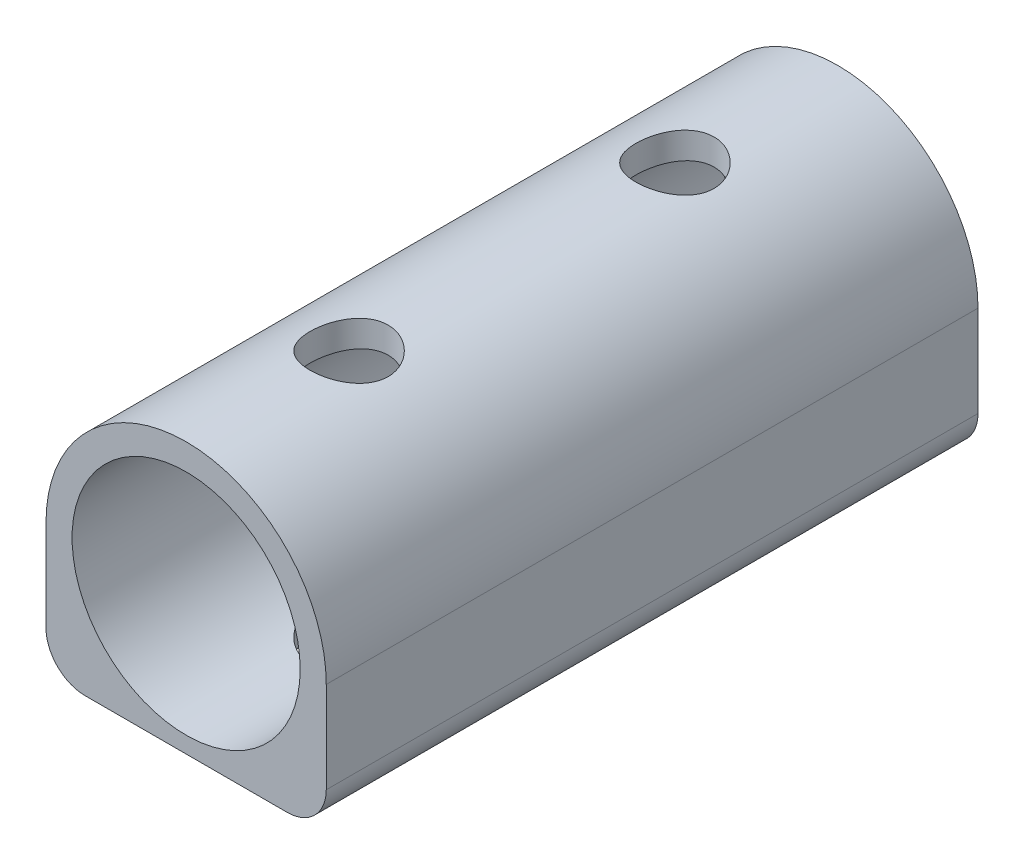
ISO-10303-21;
HEADER;
FILE_DESCRIPTION(('STEP AP214'),'2;1');
FILE_NAME('part.step','',(''),(''),'','','');
FILE_SCHEMA(('AUTOMOTIVE_DESIGN { 1 0 10303 214 1 1 1 1 }'));
ENDSEC;
DATA;
#1=APPLICATION_CONTEXT('core data for automotive mechanical design processes');
#2=APPLICATION_PROTOCOL_DEFINITION('international standard','automotive_design',2000,#1);
#3=PRODUCT_CONTEXT('',#1,'mechanical');
#4=PRODUCT('Part','Part','',(#3));
#5=PRODUCT_RELATED_PRODUCT_CATEGORY('part','',(#4));
#6=PRODUCT_DEFINITION_FORMATION('','',#4);
#7=PRODUCT_DEFINITION_CONTEXT('part definition',#1,'design');
#8=PRODUCT_DEFINITION('design','',#6,#7);
#9=PRODUCT_DEFINITION_SHAPE('','',#8);
#10=(LENGTH_UNIT() NAMED_UNIT(*) SI_UNIT(.MILLI.,.METRE.));
#11=(NAMED_UNIT(*) PLANE_ANGLE_UNIT() SI_UNIT($,.RADIAN.));
#12=(NAMED_UNIT(*) SI_UNIT($,.STERADIAN.) SOLID_ANGLE_UNIT());
#13=UNCERTAINTY_MEASURE_WITH_UNIT(LENGTH_MEASURE(1.E-05),#10,'distance_accuracy_value','');
#14=(GEOMETRIC_REPRESENTATION_CONTEXT(3) GLOBAL_UNCERTAINTY_ASSIGNED_CONTEXT((#13)) GLOBAL_UNIT_ASSIGNED_CONTEXT((#10,
#11,#12)) REPRESENTATION_CONTEXT('',''));
#15=CARTESIAN_POINT('',(0.,0.,0.));
#16=DIRECTION('',(0.,0.,1.));
#17=DIRECTION('',(1.,0.,0.));
#18=AXIS2_PLACEMENT_3D('',#15,#16,#17);
#19=CARTESIAN_POINT('',(21.5,-20.,100.));
#20=DIRECTION('',(0.,-1.,0.));
#21=DIRECTION('',(1.,0.,0.));
#22=AXIS2_PLACEMENT_3D('',#19,#20,#21);
#23=PLANE('',#22);
#24=CARTESIAN_POINT('',(0.,-20.,75.));
#25=DIRECTION('',(0.,-1.,0.));
#26=DIRECTION('',(1.,0.,0.));
#27=AXIS2_PLACEMENT_3D('',#24,#25,#26);
#28=CIRCLE('',#27,6.00000000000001);
#29=CARTESIAN_POINT('',(6.00000000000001,-20.,75.));
#30=VERTEX_POINT('',#29);
#31=EDGE_CURVE('E189',#30,#30,#28,.T.);
#32=ORIENTED_EDGE('',*,*,#31,.F.);
#33=EDGE_LOOP('',(#32));
#34=FACE_BOUND('',#33,.T.);
#35=CARTESIAN_POINT('',(0.,-20.,25.));
#36=DIRECTION('',(0.,-1.,0.));
#37=DIRECTION('',(1.,0.,0.));
#38=AXIS2_PLACEMENT_3D('',#35,#36,#37);
#39=CIRCLE('',#38,6.);
#40=CARTESIAN_POINT('',(6.,-20.,25.));
#41=VERTEX_POINT('',#40);
#42=EDGE_CURVE('E142',#41,#41,#39,.T.);
#43=ORIENTED_EDGE('',*,*,#42,.F.);
#44=EDGE_LOOP('',(#43));
#45=FACE_BOUND('',#44,.T.);
#46=DIRECTION('',(-1.,0.,0.));
#47=VECTOR('',#46,1.);
#48=CARTESIAN_POINT('',(21.5,-20.,100.));
#49=LINE('',#48,#47);
#50=CARTESIAN_POINT('',(15.5,-20.,100.));
#51=VERTEX_POINT('',#50);
#52=CARTESIAN_POINT('',(-15.5,-20.,100.));
#53=VERTEX_POINT('',#52);
#54=EDGE_CURVE('E102',#51,#53,#49,.T.);
#55=ORIENTED_EDGE('',*,*,#54,.T.);
#56=DIRECTION('',(0.,0.,-1.));
#57=VECTOR('',#56,1.);
#58=CARTESIAN_POINT('',(-15.5,-20.,100.));
#59=LINE('',#58,#57);
#60=CARTESIAN_POINT('',(-15.5,-20.,0.));
#61=VERTEX_POINT('',#60);
#62=EDGE_CURVE('E207',#53,#61,#59,.T.);
#63=ORIENTED_EDGE('',*,*,#62,.T.);
#64=DIRECTION('',(-1.,0.,0.));
#65=VECTOR('',#64,1.);
#66=CARTESIAN_POINT('',(21.5,-20.,0.));
#67=LINE('',#66,#65);
#68=CARTESIAN_POINT('',(15.5,-20.,0.));
#69=VERTEX_POINT('',#68);
#70=EDGE_CURVE('E119',#69,#61,#67,.T.);
#71=ORIENTED_EDGE('',*,*,#70,.F.);
#72=DIRECTION('',(0.,0.,-1.));
#73=VECTOR('',#72,1.);
#74=CARTESIAN_POINT('',(15.5,-20.,100.));
#75=LINE('',#74,#73);
#76=EDGE_CURVE('E126',#69,#51,#75,.F.);
#77=ORIENTED_EDGE('',*,*,#76,.T.);
#78=EDGE_LOOP('',(#55,#63,#71,#77));
#79=FACE_BOUND('',#78,.T.);
#80=ADVANCED_FACE('F43',(#34,#45,#79),#23,.T.);
#81=CARTESIAN_POINT('',(21.5,0.,100.));
#82=DIRECTION('',(1.,0.,0.));
#83=DIRECTION('',(0.,0.,-1.));
#84=AXIS2_PLACEMENT_3D('',#81,#82,#83);
#85=PLANE('',#84);
#86=DIRECTION('',(0.,-1.,0.));
#87=VECTOR('',#86,1.);
#88=CARTESIAN_POINT('',(21.5,0.,100.));
#89=LINE('',#88,#87);
#90=CARTESIAN_POINT('',(21.5,0.,100.));
#91=VERTEX_POINT('',#90);
#92=CARTESIAN_POINT('',(21.5,-14.,100.));
#93=VERTEX_POINT('',#92);
#94=EDGE_CURVE('E113',#91,#93,#89,.T.);
#95=ORIENTED_EDGE('',*,*,#94,.T.);
#96=DIRECTION('',(0.,0.,-1.));
#97=VECTOR('',#96,1.);
#98=CARTESIAN_POINT('',(21.5,-14.,100.));
#99=LINE('',#98,#97);
#100=CARTESIAN_POINT('',(21.5,-14.,0.));
#101=VERTEX_POINT('',#100);
#102=EDGE_CURVE('E12',#93,#101,#99,.T.);
#103=ORIENTED_EDGE('',*,*,#102,.T.);
#104=DIRECTION('',(0.,-1.,0.));
#105=VECTOR('',#104,1.);
#106=CARTESIAN_POINT('',(21.5,0.,0.));
#107=LINE('',#106,#105);
#108=CARTESIAN_POINT('',(21.5,0.,0.));
#109=VERTEX_POINT('',#108);
#110=EDGE_CURVE('E129',#109,#101,#107,.T.);
#111=ORIENTED_EDGE('',*,*,#110,.F.);
#112=DIRECTION('',(0.,0.,-1.));
#113=VECTOR('',#112,1.);
#114=CARTESIAN_POINT('',(21.5,0.,100.));
#115=LINE('',#114,#113);
#116=EDGE_CURVE('E115',#91,#109,#115,.T.);
#117=ORIENTED_EDGE('',*,*,#116,.F.);
#118=EDGE_LOOP('',(#95,#103,#111,#117));
#119=FACE_BOUND('',#118,.T.);
#120=ADVANCED_FACE('F176',(#119),#85,.T.);
#121=CARTESIAN_POINT('',(0.,0.,100.));
#122=DIRECTION('',(0.,0.,-1.));
#123=DIRECTION('',(-1.,0.,0.));
#124=AXIS2_PLACEMENT_3D('',#121,#122,#123);
#125=CYLINDRICAL_SURFACE('',#124,21.5);
#126=CARTESIAN_POINT('',(0.,21.5,69.));
#127=CARTESIAN_POINT('',(-0.165143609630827,21.5000041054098,68.9999937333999));
#128=CARTESIAN_POINT('',(-0.330224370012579,21.4980947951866,69.0068185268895));
#129=CARTESIAN_POINT('',(-0.659220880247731,21.4905199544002,69.0340427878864));
#130=CARTESIAN_POINT('',(-0.823136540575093,21.4848541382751,69.0544432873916));
#131=CARTESIAN_POINT('',(-1.14858698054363,21.4699163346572,69.1086522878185));
#132=CARTESIAN_POINT('',(-1.31012134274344,21.4606437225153,69.1424631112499));
#133=CARTESIAN_POINT('',(-1.62970455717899,21.4387434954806,69.2232159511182));
#134=CARTESIAN_POINT('',(-1.78775209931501,21.4261146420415,69.2701628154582));
#135=CARTESIAN_POINT('',(-2.09893404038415,21.3978701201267,69.3767023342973));
#136=CARTESIAN_POINT('',(-2.25207658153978,21.3822597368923,69.4362726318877));
#137=CARTESIAN_POINT('',(-2.55277955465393,21.3484476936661,69.5676663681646));
#138=CARTESIAN_POINT('',(-2.70033789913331,21.3302450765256,69.639494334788));
#139=CARTESIAN_POINT('',(-2.98882155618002,21.2917382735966,69.794831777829));
#140=CARTESIAN_POINT('',(-3.12974892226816,21.2714347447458,69.8783376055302));
#141=CARTESIAN_POINT('',(-3.40419492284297,21.2292426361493,70.0564958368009));
#142=CARTESIAN_POINT('',(-3.53771073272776,21.2073534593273,70.1511524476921));
#143=CARTESIAN_POINT('',(-3.79935081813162,21.16206400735,70.3531884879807));
#144=CARTESIAN_POINT('',(-3.92728843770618,21.1386409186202,70.4608045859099));
#145=CARTESIAN_POINT('',(-4.17374597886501,21.0913631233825,70.6863291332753));
#146=CARTESIAN_POINT('',(-4.29226238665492,21.0675082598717,70.8042413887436));
#147=CARTESIAN_POINT('',(-4.51904271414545,21.0200303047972,71.0495384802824));
#148=CARTESIAN_POINT('',(-4.62730892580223,20.9964071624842,71.1769211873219));
#149=CARTESIAN_POINT('',(-4.83294511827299,20.9500300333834,71.4404239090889));
#150=CARTESIAN_POINT('',(-4.93031105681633,20.9272763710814,71.5765471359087));
#151=CARTESIAN_POINT('',(-5.11514976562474,20.8828745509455,71.8592524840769));
#152=CARTESIAN_POINT('',(-5.20240303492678,20.8612550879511,72.0059827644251));
#153=CARTESIAN_POINT('',(-5.36423202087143,20.8202302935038,72.3066431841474));
#154=CARTESIAN_POINT('',(-5.43880319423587,20.8008257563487,72.4605758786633));
#155=CARTESIAN_POINT('',(-5.57461087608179,20.7648416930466,72.7744781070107));
#156=CARTESIAN_POINT('',(-5.63585169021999,20.7482612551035,72.9344456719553));
#157=CARTESIAN_POINT('',(-5.74450467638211,20.7184421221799,73.259310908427));
#158=CARTESIAN_POINT('',(-5.79191744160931,20.7052032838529,73.4242083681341));
#159=CARTESIAN_POINT('',(-5.87150705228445,20.6827723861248,73.7536388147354));
#160=CARTESIAN_POINT('',(-5.90402707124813,20.6734895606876,73.9180827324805));
#161=CARTESIAN_POINT('',(-5.95519897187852,20.6588072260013,74.2492258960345));
#162=CARTESIAN_POINT('',(-5.97385605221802,20.6534062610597,74.4159242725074));
#163=CARTESIAN_POINT('',(-5.99714855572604,20.6466548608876,74.7503799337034));
#164=CARTESIAN_POINT('',(-6.00178397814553,20.6453044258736,74.9181372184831));
#165=CARTESIAN_POINT('',(-5.99698946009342,20.6466976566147,75.2534319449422));
#166=CARTESIAN_POINT('',(-5.98755975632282,20.6494412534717,75.4209693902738));
#167=CARTESIAN_POINT('',(-5.95523378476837,20.6587865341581,75.7493764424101));
#168=CARTESIAN_POINT('',(-5.93276412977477,20.6652659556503,75.9102917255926));
#169=CARTESIAN_POINT('',(-5.87488879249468,20.6817935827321,76.229645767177));
#170=CARTESIAN_POINT('',(-5.83947869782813,20.6918430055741,76.3880836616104));
#171=CARTESIAN_POINT('',(-5.75602377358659,20.7152134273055,76.7013050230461));
#172=CARTESIAN_POINT('',(-5.70798276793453,20.7285334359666,76.8560895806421));
#173=CARTESIAN_POINT('',(-5.59965248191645,20.7580593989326,77.1610468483));
#174=CARTESIAN_POINT('',(-5.53935857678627,20.7742664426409,77.3112177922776));
#175=CARTESIAN_POINT('',(-5.33916287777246,20.8269688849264,77.7568070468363));
#176=CARTESIAN_POINT('',(-5.18088857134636,20.8672678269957,78.0437772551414));
#177=CARTESIAN_POINT('',(-4.82041010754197,20.953468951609,78.5875140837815));
#178=CARTESIAN_POINT('',(-4.61819656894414,20.9993723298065,78.844274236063));
#179=CARTESIAN_POINT('',(-4.1669213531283,21.0936408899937,79.3301880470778));
#180=CARTESIAN_POINT('',(-3.91643935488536,21.1420353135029,79.5580210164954));
#181=CARTESIAN_POINT('',(-3.38021765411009,21.2343590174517,79.9687201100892));
#182=CARTESIAN_POINT('',(-3.09447628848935,21.2782880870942,80.151584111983));
#183=CARTESIAN_POINT('',(-2.49373450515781,21.3570482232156,80.46782752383));
#184=CARTESIAN_POINT('',(-2.17859153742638,21.3918314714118,80.6009483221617));
#185=CARTESIAN_POINT('',(-1.52900133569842,21.4480302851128,80.811928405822));
#186=CARTESIAN_POINT('',(-1.19455875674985,21.4694490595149,80.8898009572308));
#187=CARTESIAN_POINT('',(-0.69185254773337,21.4895000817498,80.962296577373));
#188=CARTESIAN_POINT('',(-0.526739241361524,21.494186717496,80.97913989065));
#189=CARTESIAN_POINT('',(-0.195635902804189,21.4997451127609,80.999097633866));
#190=CARTESIAN_POINT('',(-0.0296462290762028,21.500618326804,81.0022172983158));
#191=CARTESIAN_POINT('',(0.301998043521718,21.4985191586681,80.9946916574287));
#192=CARTESIAN_POINT('',(0.467652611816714,21.4955464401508,80.9840451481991));
#193=CARTESIAN_POINT('',(0.79740025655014,21.4858407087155,80.9490869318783));
#194=CARTESIAN_POINT('',(0.961493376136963,21.4791078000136,80.9247756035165));
#195=CARTESIAN_POINT('',(1.28380886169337,21.4622315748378,80.8632958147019));
#196=CARTESIAN_POINT('',(1.44208348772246,21.4521559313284,80.8263820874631));
#197=CARTESIAN_POINT('',(1.7549013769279,21.4288338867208,80.739917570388));
#198=CARTESIAN_POINT('',(1.90944463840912,21.4155874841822,80.690366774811));
#199=CARTESIAN_POINT('',(2.21381220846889,21.3862670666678,80.5790055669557));
#200=CARTESIAN_POINT('',(2.3636353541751,21.3701923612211,80.5171921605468));
#201=CARTESIAN_POINT('',(2.65751613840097,21.3356390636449,80.3818003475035));
#202=CARTESIAN_POINT('',(2.80157561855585,21.3171612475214,80.3082257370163));
#203=CARTESIAN_POINT('',(3.08608734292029,21.2778552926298,80.1481329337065));
#204=CARTESIAN_POINT('',(3.22639761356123,21.2569855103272,80.0613726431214));
#205=CARTESIAN_POINT('',(3.49920286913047,21.2137844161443,79.8767508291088));
#206=CARTESIAN_POINT('',(3.63170040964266,21.1914535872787,79.7788929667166));
#207=CARTESIAN_POINT('',(3.88818483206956,21.1458978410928,79.5726484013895));
#208=CARTESIAN_POINT('',(4.01216709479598,21.1226724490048,79.4642560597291));
#209=CARTESIAN_POINT('',(4.25073875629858,21.0759577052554,79.2377199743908));
#210=CARTESIAN_POINT('',(4.3653313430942,21.052468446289,79.119579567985));
#211=CARTESIAN_POINT('',(4.58791497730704,21.0051039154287,78.8703770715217));
#212=CARTESIAN_POINT('',(4.6955840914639,20.9812398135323,78.7390250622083));
#213=CARTESIAN_POINT('',(4.89944606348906,20.9345733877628,78.4675966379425));
#214=CARTESIAN_POINT('',(4.9956430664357,20.911770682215,78.3275234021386));
#215=CARTESIAN_POINT('',(5.17595332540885,20.8678730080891,78.0394717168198));
#216=CARTESIAN_POINT('',(5.26006202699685,20.8467786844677,77.891490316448));
#217=CARTESIAN_POINT('',(5.41548289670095,20.8069455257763,77.5887232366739));
#218=CARTESIAN_POINT('',(5.48680028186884,20.7882057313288,77.4339403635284));
#219=CARTESIAN_POINT('',(5.61577052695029,20.7537359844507,77.1194015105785));
#220=CARTESIAN_POINT('',(5.67349222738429,20.7379909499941,76.9596754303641));
#221=CARTESIAN_POINT('',(5.77523390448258,20.7098880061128,76.6356924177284));
#222=CARTESIAN_POINT('',(5.81925926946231,20.6975287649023,76.4714372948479));
#223=CARTESIAN_POINT('',(5.89324290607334,20.676585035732,76.1395573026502));
#224=CARTESIAN_POINT('',(5.92320178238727,20.6680003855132,75.9719325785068));
#225=CARTESIAN_POINT('',(5.96877406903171,20.6548856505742,75.6345886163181));
#226=CARTESIAN_POINT('',(5.98438793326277,20.6503554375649,75.464869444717));
#227=CARTESIAN_POINT('',(6.00081922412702,20.6455863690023,75.1308210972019));
#228=CARTESIAN_POINT('',(6.00215174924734,20.6451981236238,74.9665191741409));
#229=CARTESIAN_POINT('',(5.99134077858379,20.6483381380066,74.6383390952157));
#230=CARTESIAN_POINT('',(5.9791926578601,20.6518677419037,74.4744611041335));
#231=CARTESIAN_POINT('',(5.94152940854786,20.6627348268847,74.1484457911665));
#232=CARTESIAN_POINT('',(5.91601969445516,20.6700707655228,73.9863077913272));
#233=CARTESIAN_POINT('',(5.85184788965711,20.6883297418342,73.664800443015));
#234=CARTESIAN_POINT('',(5.81318089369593,20.6992541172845,73.5054321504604));
#235=CARTESIAN_POINT('',(5.72345994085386,20.7242406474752,73.1921564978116));
#236=CARTESIAN_POINT('',(5.67252946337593,20.7382714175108,73.0382112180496));
#237=CARTESIAN_POINT('',(5.55847371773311,20.7691323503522,72.7351390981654));
#238=CARTESIAN_POINT('',(5.49534430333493,20.7859634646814,72.5860139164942));
#239=CARTESIAN_POINT('',(5.35737496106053,20.8219502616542,72.2935872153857));
#240=CARTESIAN_POINT('',(5.28253560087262,20.8411058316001,72.1502854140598));
#241=CARTESIAN_POINT('',(5.12166710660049,20.8812211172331,71.8703696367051));
#242=CARTESIAN_POINT('',(5.03563758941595,20.9021808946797,71.7337558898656));
#243=CARTESIAN_POINT('',(4.85001842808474,20.9460426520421,71.4637569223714));
#244=CARTESIAN_POINT('',(4.75008162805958,20.9689854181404,71.3306168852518));
#245=CARTESIAN_POINT('',(4.53959749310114,21.0155577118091,71.0732089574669));
#246=CARTESIAN_POINT('',(4.42905345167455,21.0391870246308,70.9489383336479));
#247=CARTESIAN_POINT('',(4.19797250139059,21.0865108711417,70.7099332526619));
#248=CARTESIAN_POINT('',(4.07742981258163,21.1102054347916,70.5952043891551));
#249=CARTESIAN_POINT('',(3.82721412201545,21.1569993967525,70.3761409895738));
#250=CARTESIAN_POINT('',(3.69754440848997,21.1800990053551,70.2718027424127));
#251=CARTESIAN_POINT('',(3.42655942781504,21.2256453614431,70.0717402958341));
#252=CARTESIAN_POINT('',(3.28503647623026,21.2480621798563,69.9762902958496));
#253=CARTESIAN_POINT('',(2.99421653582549,21.2909902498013,69.7977143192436));
#254=CARTESIAN_POINT('',(2.84492241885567,21.3115021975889,69.714583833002));
#255=CARTESIAN_POINT('',(2.53956415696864,21.3500414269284,69.5612703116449));
#256=CARTESIAN_POINT('',(2.3835020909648,21.3680694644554,69.4910833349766));
#257=CARTESIAN_POINT('',(2.06572856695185,21.4011291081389,69.3642162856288));
#258=CARTESIAN_POINT('',(1.90401779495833,21.4161610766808,69.3075345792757));
#259=CARTESIAN_POINT('',(1.45905334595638,21.4522805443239,69.1727183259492));
#260=CARTESIAN_POINT('',(1.17130650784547,21.4700497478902,69.1080803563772));
#261=CARTESIAN_POINT('',(0.588972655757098,21.4939051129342,69.0217293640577));
#262=CARTESIAN_POINT('',(0.294386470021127,21.4999926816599,69.0000111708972));
#263=CARTESIAN_POINT('',(0.,21.5,69.));
#264=B_SPLINE_CURVE_WITH_KNOTS('',3,(#126,#127,#128,#129,#130,#131,#132,#133,#134,#135,#136,
#137,#138,#139,#140,#141,#142,#143,#144,#145,#146,#147,#148,#149,#150,#151,#152,#153,#154,#155,
#156,#157,#158,#159,#160,#161,#162,#163,#164,#165,#166,#167,#168,#169,#170,#171,#172,#173,#174,
#175,#176,#177,#178,#179,#180,#181,#182,#183,#184,#185,#186,#187,#188,#189,#190,#191,#192,#193,
#194,#195,#196,#197,#198,#199,#200,#201,#202,#203,#204,#205,#206,#207,#208,#209,#210,#211,#212,
#213,#214,#215,#216,#217,#218,#219,#220,#221,#222,#223,#224,#225,#226,#227,#228,#229,#230,#231,
#232,#233,#234,#235,#236,#237,#238,#239,#240,#241,#242,#243,#244,#245,#246,#247,#248,#249,#250,
#251,#252,#253,#254,#255,#256,#257,#258,#259,#260,#261,#262,#263),.UNSPECIFIED.,.T.,.F.,(4,2,2,
2,2,2,2,2,2,2,2,2,2,2,2,2,2,2,2,2,2,2,2,2,2,2,2,2,2,2,2,2,2,2,2,2,2,2,2,2,2,2,2,2,2,2,2,2,2,2,2,
2,2,2,2,2,2,2,2,2,2,2,2,2,2,2,2,2,4),(0.,0.49517076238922,0.990379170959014,1.48567338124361,
1.98115062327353,2.4757575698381,2.97054761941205,3.46518341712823,3.96000644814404,
4.46586528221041,4.97191190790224,5.47784511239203,5.98396532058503,6.49956683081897,
7.01535266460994,7.53097165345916,8.04656851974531,8.54959899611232,9.05244073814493,
9.55528250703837,10.0581158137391,10.5453581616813,11.0327668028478,11.5200280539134,
12.0074735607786,12.9932082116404,13.9791535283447,15.000466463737,16.0218275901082,
17.0484271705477,18.0747801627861,18.5723890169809,19.0698080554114,19.5672705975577,
20.0647193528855,20.5526562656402,21.040593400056,21.5286498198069,22.0165490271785,
22.5148295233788,23.012946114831,23.5113308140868,24.0095455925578,24.5234642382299,
25.0371966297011,25.5511220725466,26.0648374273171,26.5758928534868,27.0867469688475,
27.5975791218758,28.10839511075,28.6007222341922,29.0932183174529,29.5855149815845,
30.0779953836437,30.5657104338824,31.0535915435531,31.5414490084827,32.0293231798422,
32.5328897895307,33.0363005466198,33.5400043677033,34.0435276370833,34.5594065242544,
35.0750961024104,35.590628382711,36.1060982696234,36.9889004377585,37.8715962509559),.UNSPECIFIED.);
#265=CARTESIAN_POINT('',(0.,21.5,69.));
#266=VERTEX_POINT('',#265);
#267=EDGE_CURVE('E181',#266,#266,#264,.T.);
#268=ORIENTED_EDGE('',*,*,#267,.F.);
#269=EDGE_LOOP('',(#268));
#270=FACE_BOUND('',#269,.T.);
#271=CARTESIAN_POINT('',(0.,21.5,19.));
#272=CARTESIAN_POINT('',(-0.165143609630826,21.5000041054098,18.9999937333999));
#273=CARTESIAN_POINT('',(-0.330224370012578,21.4980947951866,19.0068185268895));
#274=CARTESIAN_POINT('',(-0.659220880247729,21.4905199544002,19.0340427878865));
#275=CARTESIAN_POINT('',(-0.82313654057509,21.4848541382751,19.0544432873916));
#276=CARTESIAN_POINT('',(-1.14858698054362,21.4699163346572,19.1086522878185));
#277=CARTESIAN_POINT('',(-1.31012134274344,21.4606437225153,19.1424631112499));
#278=CARTESIAN_POINT('',(-1.62970455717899,21.4387434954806,19.2232159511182));
#279=CARTESIAN_POINT('',(-1.78775209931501,21.4261146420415,19.2701628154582));
#280=CARTESIAN_POINT('',(-2.09893404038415,21.3978701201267,19.3767023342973));
#281=CARTESIAN_POINT('',(-2.25207658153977,21.3822597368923,19.4362726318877));
#282=CARTESIAN_POINT('',(-2.55277955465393,21.3484476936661,19.5676663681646));
#283=CARTESIAN_POINT('',(-2.7003378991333,21.3302450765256,19.639494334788));
#284=CARTESIAN_POINT('',(-2.98882155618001,21.2917382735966,19.7948317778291));
#285=CARTESIAN_POINT('',(-3.12974892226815,21.2714347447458,19.8783376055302));
#286=CARTESIAN_POINT('',(-3.40419492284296,21.2292426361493,20.0564958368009));
#287=CARTESIAN_POINT('',(-3.53771073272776,21.2073534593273,20.1511524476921));
#288=CARTESIAN_POINT('',(-3.79935081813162,21.16206400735,20.3531884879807));
#289=CARTESIAN_POINT('',(-3.92728843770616,21.1386409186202,20.4608045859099));
#290=CARTESIAN_POINT('',(-4.17374597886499,21.0913631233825,20.6863291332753));
#291=CARTESIAN_POINT('',(-4.2922623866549,21.0675082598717,20.8042413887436));
#292=CARTESIAN_POINT('',(-4.51904271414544,21.0200303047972,21.0495384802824));
#293=CARTESIAN_POINT('',(-4.62730892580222,20.9964071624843,21.1769211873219));
#294=CARTESIAN_POINT('',(-4.83294511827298,20.9500300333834,21.4404239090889));
#295=CARTESIAN_POINT('',(-4.93031105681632,20.9272763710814,21.5765471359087));
#296=CARTESIAN_POINT('',(-5.11514976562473,20.8828745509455,21.8592524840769));
#297=CARTESIAN_POINT('',(-5.20240303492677,20.8612550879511,22.0059827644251));
#298=CARTESIAN_POINT('',(-5.36423202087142,20.8202302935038,22.3066431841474));
#299=CARTESIAN_POINT('',(-5.43880319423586,20.8008257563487,22.4605758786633));
#300=CARTESIAN_POINT('',(-5.57461087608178,20.7648416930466,22.7744781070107));
#301=CARTESIAN_POINT('',(-5.63585169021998,20.7482612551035,22.9344456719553));
#302=CARTESIAN_POINT('',(-5.7445046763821,20.7184421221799,23.259310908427));
#303=CARTESIAN_POINT('',(-5.7919174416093,20.7052032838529,23.424208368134));
#304=CARTESIAN_POINT('',(-5.87150705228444,20.6827723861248,23.7536388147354));
#305=CARTESIAN_POINT('',(-5.90402707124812,20.6734895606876,23.9180827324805));
#306=CARTESIAN_POINT('',(-5.95519897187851,20.6588072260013,24.2492258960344));
#307=CARTESIAN_POINT('',(-5.97385605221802,20.6534062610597,24.4159242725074));
#308=CARTESIAN_POINT('',(-5.99714855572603,20.6466548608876,24.7503799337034));
#309=CARTESIAN_POINT('',(-6.00178397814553,20.6453044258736,24.9181372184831));
#310=CARTESIAN_POINT('',(-5.99698946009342,20.6466976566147,25.2534319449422));
#311=CARTESIAN_POINT('',(-5.98755975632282,20.6494412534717,25.4209693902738));
#312=CARTESIAN_POINT('',(-5.95523378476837,20.6587865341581,25.7493764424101));
#313=CARTESIAN_POINT('',(-5.93276412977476,20.6652659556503,25.9102917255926));
#314=CARTESIAN_POINT('',(-5.87488879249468,20.6817935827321,26.229645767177));
#315=CARTESIAN_POINT('',(-5.83947869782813,20.6918430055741,26.3880836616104));
#316=CARTESIAN_POINT('',(-5.75602377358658,20.7152134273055,26.7013050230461));
#317=CARTESIAN_POINT('',(-5.70798276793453,20.7285334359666,26.8560895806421));
#318=CARTESIAN_POINT('',(-5.59965248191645,20.7580593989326,27.1610468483));
#319=CARTESIAN_POINT('',(-5.53935857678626,20.7742664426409,27.3112177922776));
#320=CARTESIAN_POINT('',(-5.33916287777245,20.8269688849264,27.7568070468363));
#321=CARTESIAN_POINT('',(-5.18088857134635,20.8672678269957,28.0437772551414));
#322=CARTESIAN_POINT('',(-4.82041010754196,20.953468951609,28.5875140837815));
#323=CARTESIAN_POINT('',(-4.61819656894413,20.9993723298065,28.844274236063));
#324=CARTESIAN_POINT('',(-4.16692135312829,21.0936408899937,29.3301880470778));
#325=CARTESIAN_POINT('',(-3.91643935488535,21.1420353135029,29.5580210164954));
#326=CARTESIAN_POINT('',(-3.38021765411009,21.2343590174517,29.9687201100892));
#327=CARTESIAN_POINT('',(-3.09447628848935,21.2782880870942,30.151584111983));
#328=CARTESIAN_POINT('',(-2.49373450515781,21.3570482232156,30.46782752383));
#329=CARTESIAN_POINT('',(-2.17859153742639,21.3918314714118,30.6009483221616));
#330=CARTESIAN_POINT('',(-1.52900133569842,21.4480302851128,30.811928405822));
#331=CARTESIAN_POINT('',(-1.19455875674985,21.4694490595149,30.8898009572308));
#332=CARTESIAN_POINT('',(-0.691852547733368,21.4895000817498,30.962296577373));
#333=CARTESIAN_POINT('',(-0.526739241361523,21.494186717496,30.97913989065));
#334=CARTESIAN_POINT('',(-0.195635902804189,21.4997451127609,30.999097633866));
#335=CARTESIAN_POINT('',(-0.0296462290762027,21.500618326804,31.0022172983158));
#336=CARTESIAN_POINT('',(0.301998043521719,21.4985191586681,30.9946916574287));
#337=CARTESIAN_POINT('',(0.467652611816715,21.4955464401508,30.9840451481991));
#338=CARTESIAN_POINT('',(0.79740025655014,21.4858407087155,30.9490869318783));
#339=CARTESIAN_POINT('',(0.961493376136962,21.4791078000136,30.9247756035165));
#340=CARTESIAN_POINT('',(1.28380886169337,21.4622315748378,30.8632958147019));
#341=CARTESIAN_POINT('',(1.44208348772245,21.4521559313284,30.8263820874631));
#342=CARTESIAN_POINT('',(1.75490137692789,21.4288338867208,30.739917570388));
#343=CARTESIAN_POINT('',(1.90944463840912,21.4155874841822,30.690366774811));
#344=CARTESIAN_POINT('',(2.21381220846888,21.3862670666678,30.5790055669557));
#345=CARTESIAN_POINT('',(2.36363535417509,21.3701923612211,30.5171921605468));
#346=CARTESIAN_POINT('',(2.65751613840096,21.3356390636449,30.3818003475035));
#347=CARTESIAN_POINT('',(2.80157561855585,21.3171612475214,30.3082257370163));
#348=CARTESIAN_POINT('',(3.08608734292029,21.2778552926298,30.1481329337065));
#349=CARTESIAN_POINT('',(3.22639761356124,21.2569855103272,30.0613726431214));
#350=CARTESIAN_POINT('',(3.49920286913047,21.2137844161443,29.8767508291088));
#351=CARTESIAN_POINT('',(3.63170040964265,21.1914535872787,29.7788929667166));
#352=CARTESIAN_POINT('',(3.88818483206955,21.1458978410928,29.5726484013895));
#353=CARTESIAN_POINT('',(4.01216709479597,21.1226724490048,29.4642560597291));
#354=CARTESIAN_POINT('',(4.25073875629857,21.0759577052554,29.2377199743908));
#355=CARTESIAN_POINT('',(4.36533134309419,21.052468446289,29.119579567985));
#356=CARTESIAN_POINT('',(4.58791497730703,21.0051039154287,28.8703770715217));
#357=CARTESIAN_POINT('',(4.69558409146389,20.9812398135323,28.7390250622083));
#358=CARTESIAN_POINT('',(4.89944606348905,20.9345733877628,28.4675966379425));
#359=CARTESIAN_POINT('',(4.99564306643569,20.911770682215,28.3275234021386));
#360=CARTESIAN_POINT('',(5.17595332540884,20.8678730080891,28.0394717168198));
#361=CARTESIAN_POINT('',(5.26006202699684,20.8467786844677,27.8914903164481));
#362=CARTESIAN_POINT('',(5.41548289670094,20.8069455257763,27.5887232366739));
#363=CARTESIAN_POINT('',(5.48680028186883,20.7882057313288,27.4339403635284));
#364=CARTESIAN_POINT('',(5.61577052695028,20.7537359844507,27.1194015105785));
#365=CARTESIAN_POINT('',(5.67349222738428,20.7379909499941,26.9596754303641));
#366=CARTESIAN_POINT('',(5.77523390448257,20.7098880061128,26.6356924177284));
#367=CARTESIAN_POINT('',(5.81925926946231,20.6975287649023,26.4714372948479));
#368=CARTESIAN_POINT('',(5.89324290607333,20.676585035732,26.1395573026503));
#369=CARTESIAN_POINT('',(5.92320178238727,20.6680003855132,25.9719325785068));
#370=CARTESIAN_POINT('',(5.96877406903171,20.6548856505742,25.6345886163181));
#371=CARTESIAN_POINT('',(5.98438793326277,20.6503554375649,25.464869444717));
#372=CARTESIAN_POINT('',(6.00081922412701,20.6455863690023,25.1308210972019));
#373=CARTESIAN_POINT('',(6.00215174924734,20.6451981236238,24.9665191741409));
#374=CARTESIAN_POINT('',(5.99134077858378,20.6483381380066,24.6383390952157));
#375=CARTESIAN_POINT('',(5.97919265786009,20.6518677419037,24.4744611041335));
#376=CARTESIAN_POINT('',(5.94152940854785,20.6627348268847,24.1484457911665));
#377=CARTESIAN_POINT('',(5.91601969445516,20.6700707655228,23.9863077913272));
#378=CARTESIAN_POINT('',(5.8518478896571,20.6883297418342,23.664800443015));
#379=CARTESIAN_POINT('',(5.81318089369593,20.6992541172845,23.5054321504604));
#380=CARTESIAN_POINT('',(5.72345994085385,20.7242406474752,23.1921564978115));
#381=CARTESIAN_POINT('',(5.67252946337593,20.7382714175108,23.0382112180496));
#382=CARTESIAN_POINT('',(5.5584737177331,20.7691323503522,22.7351390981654));
#383=CARTESIAN_POINT('',(5.49534430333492,20.7859634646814,22.5860139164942));
#384=CARTESIAN_POINT('',(5.35737496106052,20.8219502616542,22.2935872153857));
#385=CARTESIAN_POINT('',(5.28253560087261,20.8411058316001,22.1502854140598));
#386=CARTESIAN_POINT('',(5.12166710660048,20.8812211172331,21.8703696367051));
#387=CARTESIAN_POINT('',(5.03563758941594,20.9021808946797,21.7337558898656));
#388=CARTESIAN_POINT('',(4.85001842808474,20.9460426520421,21.4637569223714));
#389=CARTESIAN_POINT('',(4.75008162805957,20.9689854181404,21.3306168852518));
#390=CARTESIAN_POINT('',(4.53959749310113,21.0155577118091,21.0732089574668));
#391=CARTESIAN_POINT('',(4.42905345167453,21.0391870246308,20.9489383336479));
#392=CARTESIAN_POINT('',(4.19797250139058,21.0865108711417,20.7099332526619));
#393=CARTESIAN_POINT('',(4.07742981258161,21.1102054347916,20.5952043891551));
#394=CARTESIAN_POINT('',(3.82721412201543,21.1569993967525,20.3761409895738));
#395=CARTESIAN_POINT('',(3.69754440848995,21.1800990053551,20.2718027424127));
#396=CARTESIAN_POINT('',(3.42655942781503,21.225645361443,20.0717402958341));
#397=CARTESIAN_POINT('',(3.28503647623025,21.2480621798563,19.9762902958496));
#398=CARTESIAN_POINT('',(2.99421653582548,21.2909902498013,19.7977143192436));
#399=CARTESIAN_POINT('',(2.84492241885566,21.3115021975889,19.714583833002));
#400=CARTESIAN_POINT('',(2.53956415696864,21.3500414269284,19.5612703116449));
#401=CARTESIAN_POINT('',(2.3835020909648,21.3680694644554,19.4910833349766));
#402=CARTESIAN_POINT('',(2.06572856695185,21.4011291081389,19.3642162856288));
#403=CARTESIAN_POINT('',(1.90401779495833,21.4161610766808,19.3075345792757));
#404=CARTESIAN_POINT('',(1.45905334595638,21.4522805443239,19.1727183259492));
#405=CARTESIAN_POINT('',(1.17130650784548,21.4700497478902,19.1080803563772));
#406=CARTESIAN_POINT('',(0.588972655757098,21.4939051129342,19.0217293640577));
#407=CARTESIAN_POINT('',(0.294386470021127,21.4999926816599,19.0000111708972));
#408=CARTESIAN_POINT('',(0.,21.5,19.));
#409=B_SPLINE_CURVE_WITH_KNOTS('',3,(#271,#272,#273,#274,#275,#276,#277,#278,#279,#280,#281,
#282,#283,#284,#285,#286,#287,#288,#289,#290,#291,#292,#293,#294,#295,#296,#297,#298,#299,#300,
#301,#302,#303,#304,#305,#306,#307,#308,#309,#310,#311,#312,#313,#314,#315,#316,#317,#318,#319,
#320,#321,#322,#323,#324,#325,#326,#327,#328,#329,#330,#331,#332,#333,#334,#335,#336,#337,#338,
#339,#340,#341,#342,#343,#344,#345,#346,#347,#348,#349,#350,#351,#352,#353,#354,#355,#356,#357,
#358,#359,#360,#361,#362,#363,#364,#365,#366,#367,#368,#369,#370,#371,#372,#373,#374,#375,#376,
#377,#378,#379,#380,#381,#382,#383,#384,#385,#386,#387,#388,#389,#390,#391,#392,#393,#394,#395,
#396,#397,#398,#399,#400,#401,#402,#403,#404,#405,#406,#407,#408),.UNSPECIFIED.,.T.,.F.,(4,2,2,
2,2,2,2,2,2,2,2,2,2,2,2,2,2,2,2,2,2,2,2,2,2,2,2,2,2,2,2,2,2,2,2,2,2,2,2,2,2,2,2,2,2,2,2,2,2,2,2,
2,2,2,2,2,2,2,2,2,2,2,2,2,2,2,2,2,4),(0.,0.495170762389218,0.990379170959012,1.48567338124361,
1.98115062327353,2.4757575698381,2.97054761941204,3.46518341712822,3.96000644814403,
4.46586528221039,4.97191190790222,5.47784511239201,5.98396532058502,6.49956683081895,
7.01535266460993,7.53097165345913,8.04656851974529,8.54959899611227,9.05244073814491,
9.55528250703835,10.0581158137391,10.5453581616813,11.0327668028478,11.5200280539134,
12.0074735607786,12.9932082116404,13.9791535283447,15.000466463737,16.0218275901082,
17.0484271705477,18.0747801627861,18.5723890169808,19.0698080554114,19.5672705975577,
20.0647193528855,20.5526562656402,21.0405934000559,21.5286498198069,22.0165490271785,
22.5148295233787,23.012946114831,23.5113308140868,24.0095455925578,24.5234642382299,
25.037196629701,25.5511220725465,26.0648374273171,26.5758928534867,27.0867469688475,
27.5975791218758,28.10839511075,28.6007222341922,29.0932183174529,29.5855149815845,
30.0779953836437,30.5657104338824,31.0535915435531,31.5414490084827,32.0293231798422,
32.5328897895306,33.0363005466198,33.5400043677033,34.0435276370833,34.5594065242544,
35.0750961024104,35.590628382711,36.1060982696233,36.9889004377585,37.8715962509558),.UNSPECIFIED.);
#410=CARTESIAN_POINT('',(0.,21.5,19.));
#411=VERTEX_POINT('',#410);
#412=EDGE_CURVE('E163',#411,#411,#409,.T.);
#413=ORIENTED_EDGE('',*,*,#412,.F.);
#414=EDGE_LOOP('',(#413));
#415=FACE_BOUND('',#414,.T.);
#416=CARTESIAN_POINT('',(0.,0.,0.));
#417=DIRECTION('',(0.,0.,-1.));
#418=DIRECTION('',(-1.,0.,0.));
#419=AXIS2_PLACEMENT_3D('',#416,#417,#418);
#420=CIRCLE('',#419,21.5);
#421=CARTESIAN_POINT('',(-21.5,0.,0.));
#422=VERTEX_POINT('',#421);
#423=EDGE_CURVE('E111',#422,#109,#420,.T.);
#424=ORIENTED_EDGE('',*,*,#423,.F.);
#425=DIRECTION('',(0.,0.,-1.));
#426=VECTOR('',#425,1.);
#427=CARTESIAN_POINT('',(-21.5,0.,100.));
#428=LINE('',#427,#426);
#429=CARTESIAN_POINT('',(-21.5,0.,100.));
#430=VERTEX_POINT('',#429);
#431=EDGE_CURVE('E99',#430,#422,#428,.T.);
#432=ORIENTED_EDGE('',*,*,#431,.F.);
#433=CARTESIAN_POINT('',(0.,0.,100.));
#434=DIRECTION('',(0.,0.,-1.));
#435=DIRECTION('',(-1.,0.,0.));
#436=AXIS2_PLACEMENT_3D('',#433,#434,#435);
#437=CIRCLE('',#436,21.5);
#438=EDGE_CURVE('E104',#430,#91,#437,.T.);
#439=ORIENTED_EDGE('',*,*,#438,.T.);
#440=ORIENTED_EDGE('',*,*,#116,.T.);
#441=EDGE_LOOP('',(#424,#432,#439,#440));
#442=FACE_BOUND('',#441,.T.);
#443=ADVANCED_FACE('F107',(#270,#415,#442),#125,.T.);
#444=CARTESIAN_POINT('',(-21.5,-20.,100.));
#445=DIRECTION('',(-1.,0.,0.));
#446=DIRECTION('',(0.,0.,1.));
#447=AXIS2_PLACEMENT_3D('',#444,#445,#446);
#448=PLANE('',#447);
#449=DIRECTION('',(0.,1.,0.));
#450=VECTOR('',#449,1.);
#451=CARTESIAN_POINT('',(-21.5,-20.,0.));
#452=LINE('',#451,#450);
#453=CARTESIAN_POINT('',(-21.5,-14.,0.));
#454=VERTEX_POINT('',#453);
#455=EDGE_CURVE('E124',#454,#422,#452,.T.);
#456=ORIENTED_EDGE('',*,*,#455,.F.);
#457=DIRECTION('',(0.,0.,-1.));
#458=VECTOR('',#457,1.);
#459=CARTESIAN_POINT('',(-21.5,-14.,100.));
#460=LINE('',#459,#458);
#461=CARTESIAN_POINT('',(-21.5,-14.,100.));
#462=VERTEX_POINT('',#461);
#463=EDGE_CURVE('E67',#454,#462,#460,.F.);
#464=ORIENTED_EDGE('',*,*,#463,.T.);
#465=DIRECTION('',(0.,1.,0.));
#466=VECTOR('',#465,1.);
#467=CARTESIAN_POINT('',(-21.5,-20.,100.));
#468=LINE('',#467,#466);
#469=EDGE_CURVE('E97',#462,#430,#468,.T.);
#470=ORIENTED_EDGE('',*,*,#469,.T.);
#471=ORIENTED_EDGE('',*,*,#431,.T.);
#472=EDGE_LOOP('',(#456,#464,#470,#471));
#473=FACE_BOUND('',#472,.T.);
#474=ADVANCED_FACE('F100',(#473),#448,.T.);
#475=CARTESIAN_POINT('',(0.,0.,100.));
#476=DIRECTION('',(0.,0.,-1.));
#477=DIRECTION('',(-1.,0.,0.));
#478=AXIS2_PLACEMENT_3D('',#475,#476,#477);
#479=PLANE('',#478);
#480=CARTESIAN_POINT('',(0.,0.,100.));
#481=DIRECTION('',(0.,0.,1.));
#482=DIRECTION('',(1.,0.,0.));
#483=AXIS2_PLACEMENT_3D('',#480,#481,#482);
#484=CIRCLE('',#483,17.5);
#485=CARTESIAN_POINT('',(17.5,0.,100.));
#486=VERTEX_POINT('',#485);
#487=EDGE_CURVE('E169',#486,#486,#484,.T.);
#488=ORIENTED_EDGE('',*,*,#487,.F.);
#489=EDGE_LOOP('',(#488));
#490=FACE_BOUND('',#489,.T.);
#491=ORIENTED_EDGE('',*,*,#469,.F.);
#492=CARTESIAN_POINT('',(-15.5,-14.,100.));
#493=DIRECTION('',(0.,0.,-1.));
#494=DIRECTION('',(-1.,0.,0.));
#495=AXIS2_PLACEMENT_3D('',#492,#493,#494);
#496=CIRCLE('',#495,6.);
#497=EDGE_CURVE('E51',#462,#53,#496,.F.);
#498=ORIENTED_EDGE('',*,*,#497,.T.);
#499=ORIENTED_EDGE('',*,*,#54,.F.);
#500=CARTESIAN_POINT('',(15.5,-14.,100.));
#501=DIRECTION('',(0.,0.,-1.));
#502=DIRECTION('',(-1.,0.,0.));
#503=AXIS2_PLACEMENT_3D('',#500,#501,#502);
#504=CIRCLE('',#503,6.);
#505=EDGE_CURVE('E59',#51,#93,#504,.F.);
#506=ORIENTED_EDGE('',*,*,#505,.T.);
#507=ORIENTED_EDGE('',*,*,#94,.F.);
#508=ORIENTED_EDGE('',*,*,#438,.F.);
#509=EDGE_LOOP('',(#491,#498,#499,#506,#507,#508));
#510=FACE_BOUND('',#509,.T.);
#511=ADVANCED_FACE('F114',(#490,#510),#479,.F.);
#512=CARTESIAN_POINT('',(0.,0.,0.));
#513=DIRECTION('',(0.,0.,-1.));
#514=DIRECTION('',(-1.,0.,0.));
#515=AXIS2_PLACEMENT_3D('',#512,#513,#514);
#516=PLANE('',#515);
#517=CARTESIAN_POINT('',(0.,0.,0.));
#518=DIRECTION('',(0.,0.,1.));
#519=DIRECTION('',(1.,0.,0.));
#520=AXIS2_PLACEMENT_3D('',#517,#518,#519);
#521=CIRCLE('',#520,17.5);
#522=CARTESIAN_POINT('',(17.5,0.,0.));
#523=VERTEX_POINT('',#522);
#524=EDGE_CURVE('E121',#523,#523,#521,.T.);
#525=ORIENTED_EDGE('',*,*,#524,.T.);
#526=EDGE_LOOP('',(#525));
#527=FACE_BOUND('',#526,.T.);
#528=ORIENTED_EDGE('',*,*,#70,.T.);
#529=CARTESIAN_POINT('',(-15.5,-14.,0.));
#530=DIRECTION('',(0.,0.,-1.));
#531=DIRECTION('',(-1.,0.,0.));
#532=AXIS2_PLACEMENT_3D('',#529,#530,#531);
#533=CIRCLE('',#532,6.);
#534=EDGE_CURVE('E213',#61,#454,#533,.T.);
#535=ORIENTED_EDGE('',*,*,#534,.T.);
#536=ORIENTED_EDGE('',*,*,#455,.T.);
#537=ORIENTED_EDGE('',*,*,#423,.T.);
#538=ORIENTED_EDGE('',*,*,#110,.T.);
#539=CARTESIAN_POINT('',(15.5,-14.,0.));
#540=DIRECTION('',(0.,0.,-1.));
#541=DIRECTION('',(-1.,0.,0.));
#542=AXIS2_PLACEMENT_3D('',#539,#540,#541);
#543=CIRCLE('',#542,6.);
#544=EDGE_CURVE('E209',#101,#69,#543,.T.);
#545=ORIENTED_EDGE('',*,*,#544,.T.);
#546=EDGE_LOOP('',(#528,#535,#536,#537,#538,#545));
#547=FACE_BOUND('',#546,.T.);
#548=ADVANCED_FACE('F222',(#527,#547),#516,.T.);
#549=CARTESIAN_POINT('',(0.,0.,0.));
#550=DIRECTION('',(0.,0.,1.));
#551=DIRECTION('',(1.,0.,0.));
#552=AXIS2_PLACEMENT_3D('',#549,#550,#551);
#553=CYLINDRICAL_SURFACE('',#552,17.5);
#554=CARTESIAN_POINT('',(6.00000000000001,16.4392822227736,75.));
#555=CARTESIAN_POINT('',(6.00000020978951,16.4392820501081,74.8369295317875));
#556=CARTESIAN_POINT('',(5.99334652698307,16.4417151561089,74.673862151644));
#557=CARTESIAN_POINT('',(5.96679536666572,16.4513693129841,74.3488938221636));
#558=CARTESIAN_POINT('',(5.94689317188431,16.4585920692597,74.1869933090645));
#559=CARTESIAN_POINT('',(5.89404592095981,16.4775910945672,73.8656594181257));
#560=CARTESIAN_POINT('',(5.86110466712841,16.4893660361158,73.7062253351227));
#561=CARTESIAN_POINT('',(5.78247648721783,16.5171032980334,73.3908420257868));
#562=CARTESIAN_POINT('',(5.73678456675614,16.5330672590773,73.2348941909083));
#563=CARTESIAN_POINT('',(5.6331956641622,16.5686479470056,72.9279780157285));
#564=CARTESIAN_POINT('',(5.57532925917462,16.5882555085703,72.7769982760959));
#565=CARTESIAN_POINT('',(5.44777240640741,16.6305829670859,72.4805097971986));
#566=CARTESIAN_POINT('',(5.37807756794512,16.6533040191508,72.3350031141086));
#567=CARTESIAN_POINT('',(5.22741263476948,16.7012095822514,72.0504107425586));
#568=CARTESIAN_POINT('',(5.14644446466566,16.7263936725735,71.911323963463));
#569=CARTESIAN_POINT('',(4.9737477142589,16.7785568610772,71.6402878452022));
#570=CARTESIAN_POINT('',(4.88201526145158,16.8055366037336,71.5083410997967));
#571=CARTESIAN_POINT('',(4.68476080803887,16.8616107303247,71.2475694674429));
#572=CARTESIAN_POINT('',(4.5788509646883,16.8907464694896,71.1190466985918));
#573=CARTESIAN_POINT('',(4.35676694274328,16.949388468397,70.871288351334));
#574=CARTESIAN_POINT('',(4.24059255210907,16.9788947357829,70.7520529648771));
#575=CARTESIAN_POINT('',(3.99864232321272,17.0374984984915,70.5235554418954));
#576=CARTESIAN_POINT('',(3.87286319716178,17.0665958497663,70.4142967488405));
#577=CARTESIAN_POINT('',(3.61253423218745,17.1235902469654,70.2065334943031));
#578=CARTESIAN_POINT('',(3.47798746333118,17.1514877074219,70.1080252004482));
#579=CARTESIAN_POINT('',(3.19696959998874,17.2061164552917,69.9197649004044));
#580=CARTESIAN_POINT('',(3.05026898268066,17.2327925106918,69.8303389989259));
#581=CARTESIAN_POINT('',(2.74942302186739,17.283342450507,69.6642541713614));
#582=CARTESIAN_POINT('',(2.59528065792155,17.3072174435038,69.5875901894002));
#583=CARTESIAN_POINT('',(2.2805222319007,17.3514978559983,69.4476231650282));
#584=CARTESIAN_POINT('',(2.11990492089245,17.3719026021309,69.3843227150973));
#585=CARTESIAN_POINT('',(1.79346074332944,17.4086317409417,69.2717110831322));
#586=CARTESIAN_POINT('',(1.62763628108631,17.4249579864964,69.2223935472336));
#587=CARTESIAN_POINT('',(1.29806992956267,17.4525459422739,69.1397250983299));
#588=CARTESIAN_POINT('',(1.13447047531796,17.4639697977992,69.105860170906));
#589=CARTESIAN_POINT('',(0.804832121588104,17.4822618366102,69.0518805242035));
#590=CARTESIAN_POINT('',(0.63879426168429,17.4891319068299,69.0317601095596));
#591=CARTESIAN_POINT('',(0.305496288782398,17.4981274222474,69.0054511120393));
#592=CARTESIAN_POINT('',(0.138236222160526,17.5002530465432,68.9992620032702));
#593=CARTESIAN_POINT('',(-0.196206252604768,17.4996989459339,69.0008780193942));
#594=CARTESIAN_POINT('',(-0.363388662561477,17.4970193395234,69.0086827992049));
#595=CARTESIAN_POINT('',(-0.689423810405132,17.487143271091,69.0375883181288));
#596=CARTESIAN_POINT('',(-0.848333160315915,17.4801398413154,69.0581209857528));
#597=CARTESIAN_POINT('',(-1.16382403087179,17.4619726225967,69.1117808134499));
#598=CARTESIAN_POINT('',(-1.3204047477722,17.4508074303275,69.1449122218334));
#599=CARTESIAN_POINT('',(-1.63006378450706,17.4246099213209,69.2234612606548));
#600=CARTESIAN_POINT('',(-1.78314322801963,17.4095788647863,69.2688748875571));
#601=CARTESIAN_POINT('',(-2.08491166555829,17.3760237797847,69.3716290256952));
#602=CARTESIAN_POINT('',(-2.2335989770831,17.3574984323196,69.4289740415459));
#603=CARTESIAN_POINT('',(-2.52751919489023,17.3171574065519,69.5559563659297));
#604=CARTESIAN_POINT('',(-2.67268110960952,17.2953017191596,69.6257451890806));
#605=CARTESIAN_POINT('',(-2.9566600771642,17.2490251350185,69.776589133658));
#606=CARTESIAN_POINT('',(-3.09547493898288,17.2246033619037,69.857648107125));
#607=CARTESIAN_POINT('',(-3.36591516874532,17.1738041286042,70.0304560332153));
#608=CARTESIAN_POINT('',(-3.49754007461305,17.1474265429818,70.1222056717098));
#609=CARTESIAN_POINT('',(-3.75285929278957,17.093363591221,70.3158013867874));
#610=CARTESIAN_POINT('',(-3.87655329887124,17.0656781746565,70.417647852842));
#611=CARTESIAN_POINT('',(-4.12128157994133,17.0082807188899,70.6361406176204));
#612=CARTESIAN_POINT('',(-4.24187601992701,16.9785364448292,70.7532715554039));
#613=CARTESIAN_POINT('',(-4.47279264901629,16.9191707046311,70.9972102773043));
#614=CARTESIAN_POINT('',(-4.5831180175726,16.8895492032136,71.1240150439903));
#615=CARTESIAN_POINT('',(-4.79289718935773,16.8312209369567,71.3866365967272));
#616=CARTESIAN_POINT('',(-4.8923450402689,16.802514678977,71.5224582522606));
#617=CARTESIAN_POINT('',(-5.07958864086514,16.7468599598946,71.8021736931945));
#618=CARTESIAN_POINT('',(-5.16738893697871,16.7199108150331,71.9460642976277));
#619=CARTESIAN_POINT('',(-5.33207368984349,16.6681302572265,72.243488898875));
#620=CARTESIAN_POINT('',(-5.40875646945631,16.6433406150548,72.3971420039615));
#621=CARTESIAN_POINT('',(-5.54880077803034,16.597175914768,72.7108298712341));
#622=CARTESIAN_POINT('',(-5.61216753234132,16.575799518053,72.8708621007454));
#623=CARTESIAN_POINT('',(-5.72502933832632,16.537158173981,73.1962042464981));
#624=CARTESIAN_POINT('',(-5.77452665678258,16.5198925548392,73.3615132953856));
#625=CARTESIAN_POINT('',(-5.85916726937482,16.4900629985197,73.6961805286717));
#626=CARTESIAN_POINT('',(-5.89431135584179,16.477498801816,73.8655384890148));
#627=CARTESIAN_POINT('',(-5.94855511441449,16.4579914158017,74.1988528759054));
#628=CARTESIAN_POINT('',(-5.96833655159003,16.4508099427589,74.3626846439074));
#629=CARTESIAN_POINT('',(-5.99433649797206,16.4413540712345,74.6915598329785));
#630=CARTESIAN_POINT('',(-6.00055552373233,16.4390794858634,74.8566032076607));
#631=CARTESIAN_POINT('',(-5.99936668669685,16.4395133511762,75.1866049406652));
#632=CARTESIAN_POINT('',(-5.99196115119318,16.4422209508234,75.3515633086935));
#633=CARTESIAN_POINT('',(-5.96360480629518,16.4525269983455,75.6801549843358));
#634=CARTESIAN_POINT('',(-5.94265418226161,16.4601253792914,75.8437883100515));
#635=CARTESIAN_POINT('',(-5.8884536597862,16.4795906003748,76.1624332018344));
#636=CARTESIAN_POINT('',(-5.8556920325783,16.4912875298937,76.3175386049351));
#637=CARTESIAN_POINT('',(-5.77809602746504,16.5186348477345,76.6243953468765));
#638=CARTESIAN_POINT('',(-5.73325766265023,16.5342865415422,76.7761455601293));
#639=CARTESIAN_POINT('',(-5.63190137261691,16.5690842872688,77.075238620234));
#640=CARTESIAN_POINT('',(-5.57538601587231,16.5882295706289,77.2225824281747));
#641=CARTESIAN_POINT('',(-5.4510861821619,16.629490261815,77.5120675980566));
#642=CARTESIAN_POINT('',(-5.38329741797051,16.6516067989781,77.6542069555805));
#643=CARTESIAN_POINT('',(-5.23455259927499,16.6989744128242,77.9369724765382));
#644=CARTESIAN_POINT('',(-5.15323830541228,16.7243043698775,78.0773969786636));
#645=CARTESIAN_POINT('',(-4.9796595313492,16.7768057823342,78.3510072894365));
#646=CARTESIAN_POINT('',(-4.88739127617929,16.8039778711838,78.4841905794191));
#647=CARTESIAN_POINT('',(-4.69250826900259,16.8594373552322,78.7425323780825));
#648=CARTESIAN_POINT('',(-4.58989244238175,16.8877248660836,78.867690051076));
#649=CARTESIAN_POINT('',(-4.37493801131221,16.944682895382,79.1092651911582));
#650=CARTESIAN_POINT('',(-4.26259916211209,16.9733534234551,79.2256824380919));
#651=CARTESIAN_POINT('',(-4.02280316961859,17.0318248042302,79.4548807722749));
#652=CARTESIAN_POINT('',(-3.89486492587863,17.0616075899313,79.56716379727));
#653=CARTESIAN_POINT('',(-3.62978885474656,17.1199603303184,79.7805410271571));
#654=CARTESIAN_POINT('',(-3.49265410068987,17.1485306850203,79.8816389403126));
#655=CARTESIAN_POINT('',(-3.20994761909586,17.2036909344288,80.0720101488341));
#656=CARTESIAN_POINT('',(-3.06437264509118,17.2302800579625,80.161278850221));
#657=CARTESIAN_POINT('',(-2.76583632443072,17.2807133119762,80.3272226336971));
#658=CARTESIAN_POINT('',(-2.61287812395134,17.3045585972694,80.4039030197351));
#659=CARTESIAN_POINT('',(-2.30143897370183,17.3487166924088,80.5436760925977));
#660=CARTESIAN_POINT('',(-2.14299427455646,17.3690487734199,80.6068433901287));
#661=CARTESIAN_POINT('',(-1.82095172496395,17.4057572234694,80.7195475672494));
#662=CARTESIAN_POINT('',(-1.65735601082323,17.4221352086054,80.7690900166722));
#663=CARTESIAN_POINT('',(-1.32618770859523,17.4504681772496,80.8540965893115));
#664=CARTESIAN_POINT('',(-1.15861557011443,17.4624236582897,80.8895622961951));
#665=CARTESIAN_POINT('',(-0.82078826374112,17.48155952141,80.9460602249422));
#666=CARTESIAN_POINT('',(-0.650533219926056,17.4887401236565,80.967093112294));
#667=CARTESIAN_POINT('',(-0.317220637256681,17.4978790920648,80.9938234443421));
#668=CARTESIAN_POINT('',(-0.15422633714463,17.5000794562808,81.0002316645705));
#669=CARTESIAN_POINT('',(0.171798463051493,17.499916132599,80.9997554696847));
#670=CARTESIAN_POINT('',(0.334828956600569,17.4975508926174,80.9928665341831));
#671=CARTESIAN_POINT('',(0.659583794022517,17.4883197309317,80.9658601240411));
#672=CARTESIAN_POINT('',(0.821308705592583,17.481455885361,80.9457487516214));
#673=CARTESIAN_POINT('',(1.14241261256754,17.4634121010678,80.8924858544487));
#674=CARTESIAN_POINT('',(1.30179070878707,17.4522305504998,80.859329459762));
#675=CARTESIAN_POINT('',(1.61416679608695,17.4260893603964,80.7809970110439));
#676=CARTESIAN_POINT('',(1.76722801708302,17.411201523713,80.7360486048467));
#677=CARTESIAN_POINT('',(2.06900037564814,17.3779253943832,80.6342351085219));
#678=CARTESIAN_POINT('',(2.2177099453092,17.3595358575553,80.5773657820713));
#679=CARTESIAN_POINT('',(2.50976737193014,17.3197224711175,80.4521835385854));
#680=CARTESIAN_POINT('',(2.65311638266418,17.2982992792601,80.3838731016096));
#681=CARTESIAN_POINT('',(2.93369200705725,17.2529318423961,80.2362762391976));
#682=CARTESIAN_POINT('',(3.07091640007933,17.2289866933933,80.1569858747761));
#683=CARTESIAN_POINT('',(3.34351240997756,17.1782092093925,79.9847664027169));
#684=CARTESIAN_POINT('',(3.47861469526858,17.1513016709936,79.8914330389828));
#685=CARTESIAN_POINT('',(3.74054432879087,17.0960886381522,79.6941677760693));
#686=CARTESIAN_POINT('',(3.86737136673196,17.0677830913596,79.5902354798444));
#687=CARTESIAN_POINT('',(4.1120725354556,17.0104867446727,79.3723799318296));
#688=CARTESIAN_POINT('',(4.22994255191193,16.9814956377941,79.2584521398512));
#689=CARTESIAN_POINT('',(4.45594184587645,16.9235985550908,79.0213674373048));
#690=CARTESIAN_POINT('',(4.56407421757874,16.8946925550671,78.8982134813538));
#691=CARTESIAN_POINT('',(4.77437334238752,16.8365009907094,78.6379291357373));
#692=CARTESIAN_POINT('',(4.87609069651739,16.8072515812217,78.5004270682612));
#693=CARTESIAN_POINT('',(5.06753124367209,16.7505252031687,78.217041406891));
#694=CARTESIAN_POINT('',(5.15725888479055,16.7230475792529,78.0711609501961));
#695=CARTESIAN_POINT('',(5.32411079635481,16.6706777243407,77.7718596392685));
#696=CARTESIAN_POINT('',(5.40123162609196,16.6457861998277,77.6184367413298));
#697=CARTESIAN_POINT('',(5.54216837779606,16.5993938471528,77.3051794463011));
#698=CARTESIAN_POINT('',(5.60599024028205,16.5778915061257,77.1453479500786));
#699=CARTESIAN_POINT('',(5.71833755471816,16.5394695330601,76.8244907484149));
#700=CARTESIAN_POINT('',(5.76721168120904,16.5224469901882,76.6635995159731));
#701=CARTESIAN_POINT('',(5.85133566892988,16.4928427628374,76.3379596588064));
#702=CARTESIAN_POINT('',(5.88659125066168,16.4802592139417,76.1732126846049));
#703=CARTESIAN_POINT('',(5.94314603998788,16.4599489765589,75.8410652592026));
#704=CARTESIAN_POINT('',(5.96444718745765,16.4522216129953,75.6736651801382));
#705=CARTESIAN_POINT('',(5.99287387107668,16.4418883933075,75.3375089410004));
#706=CARTESIAN_POINT('',(5.9999997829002,16.4392824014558,75.1687528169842));
#707=CARTESIAN_POINT('',(6.00000000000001,16.4392822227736,75.));
#708=B_SPLINE_CURVE_WITH_KNOTS('',3,(#554,#555,#556,#557,#558,#559,#560,#561,#562,#563,#564,
#565,#566,#567,#568,#569,#570,#571,#572,#573,#574,#575,#576,#577,#578,#579,#580,#581,#582,#583,
#584,#585,#586,#587,#588,#589,#590,#591,#592,#593,#594,#595,#596,#597,#598,#599,#600,#601,#602,
#603,#604,#605,#606,#607,#608,#609,#610,#611,#612,#613,#614,#615,#616,#617,#618,#619,#620,#621,
#622,#623,#624,#625,#626,#627,#628,#629,#630,#631,#632,#633,#634,#635,#636,#637,#638,#639,#640,
#641,#642,#643,#644,#645,#646,#647,#648,#649,#650,#651,#652,#653,#654,#655,#656,#657,#658,#659,
#660,#661,#662,#663,#664,#665,#666,#667,#668,#669,#670,#671,#672,#673,#674,#675,#676,#677,#678,
#679,#680,#681,#682,#683,#684,#685,#686,#687,#688,#689,#690,#691,#692,#693,#694,#695,#696,#697,
#698,#699,#700,#701,#702,#703,#704,#705,#706,#707),.UNSPECIFIED.,.T.,.F.,(4,2,2,2,2,2,2,2,2,2,2,
2,2,2,2,2,2,2,2,2,2,2,2,2,2,2,2,2,2,2,2,2,2,2,2,2,2,2,2,2,2,2,2,2,2,2,2,2,2,2,2,2,2,2,2,2,2,2,2,
2,2,2,2,2,2,2,2,2,2,2,2,2,2,2,2,2,4),(0.,0.489053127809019,0.978280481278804,1.46736527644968,
1.95664191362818,2.44470405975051,2.93294777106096,3.42110823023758,3.90944484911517,
4.41607526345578,4.92271614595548,5.42953124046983,5.93616981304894,6.45712530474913,
6.97787391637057,7.49872345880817,8.01933594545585,8.52107494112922,9.02260590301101,
9.5241179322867,10.0256175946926,10.5062026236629,10.9869498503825,11.4675405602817,
11.9483130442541,12.435398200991,12.9226502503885,13.4099335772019,13.897235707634,
14.4088254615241,14.9202562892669,15.4319655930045,15.943474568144,16.4633367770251,
16.9829946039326,17.5025674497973,18.0221116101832,18.5170203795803,19.011910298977,
19.5067156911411,20.0015143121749,20.4778440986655,20.954331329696,21.4307138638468,
21.907277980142,22.3994341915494,22.8917605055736,23.3841380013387,23.8765278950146,
24.39433984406,24.9119796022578,25.4298198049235,25.9474412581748,26.462126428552,
26.9766008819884,27.4910174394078,28.005410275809,28.4942161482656,28.9831882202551,
29.4719347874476,29.9608639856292,30.440972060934,30.9212510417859,31.4014260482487,
31.8817737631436,32.3804049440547,32.8790548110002,33.3779323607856,33.8766508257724,
34.3965827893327,34.9163213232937,35.436201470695,35.9558488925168,36.4622402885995,
36.9684187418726,37.4745268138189,37.9806214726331),.UNSPECIFIED.);
#709=CARTESIAN_POINT('',(6.00000000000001,16.4392822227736,75.));
#710=VERTEX_POINT('',#709);
#711=EDGE_CURVE('E190',#710,#710,#708,.T.);
#712=ORIENTED_EDGE('',*,*,#711,.T.);
#713=EDGE_LOOP('',(#712));
#714=FACE_BOUND('',#713,.T.);
#715=CARTESIAN_POINT('',(6.00000000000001,-16.4392822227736,75.));
#716=CARTESIAN_POINT('',(6.0000002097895,-16.4392820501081,75.1630704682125));
#717=CARTESIAN_POINT('',(5.99334652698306,-16.4417151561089,75.326137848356));
#718=CARTESIAN_POINT('',(5.96679536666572,-16.4513693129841,75.6511061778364));
#719=CARTESIAN_POINT('',(5.9468931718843,-16.4585920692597,75.8130066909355));
#720=CARTESIAN_POINT('',(5.8940459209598,-16.4775910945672,76.1343405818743));
#721=CARTESIAN_POINT('',(5.86110466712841,-16.4893660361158,76.2937746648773));
#722=CARTESIAN_POINT('',(5.78247648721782,-16.5171032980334,76.6091579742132));
#723=CARTESIAN_POINT('',(5.73678456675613,-16.5330672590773,76.7651058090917));
#724=CARTESIAN_POINT('',(5.63319566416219,-16.5686479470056,77.0720219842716));
#725=CARTESIAN_POINT('',(5.57532925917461,-16.5882555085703,77.2230017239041));
#726=CARTESIAN_POINT('',(5.4477724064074,-16.6305829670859,77.5194902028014));
#727=CARTESIAN_POINT('',(5.37807756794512,-16.6533040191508,77.6649968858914));
#728=CARTESIAN_POINT('',(5.22741263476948,-16.7012095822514,77.9495892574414));
#729=CARTESIAN_POINT('',(5.14644446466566,-16.7263936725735,78.088676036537));
#730=CARTESIAN_POINT('',(4.97374771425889,-16.7785568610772,78.3597121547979));
#731=CARTESIAN_POINT('',(4.88201526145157,-16.8055366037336,78.4916589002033));
#732=CARTESIAN_POINT('',(4.68476080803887,-16.8616107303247,78.7524305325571));
#733=CARTESIAN_POINT('',(4.5788509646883,-16.8907464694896,78.8809533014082));
#734=CARTESIAN_POINT('',(4.35676694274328,-16.949388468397,79.128711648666));
#735=CARTESIAN_POINT('',(4.24059255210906,-16.9788947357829,79.2479470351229));
#736=CARTESIAN_POINT('',(3.99864232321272,-17.0374984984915,79.4764445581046));
#737=CARTESIAN_POINT('',(3.87286319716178,-17.0665958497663,79.5857032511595));
#738=CARTESIAN_POINT('',(3.61253423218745,-17.1235902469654,79.7934665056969));
#739=CARTESIAN_POINT('',(3.47798746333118,-17.1514877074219,79.8919747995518));
#740=CARTESIAN_POINT('',(3.19696959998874,-17.2061164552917,80.0802350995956));
#741=CARTESIAN_POINT('',(3.05026898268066,-17.2327925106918,80.1696610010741));
#742=CARTESIAN_POINT('',(2.74942302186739,-17.283342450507,80.3357458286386));
#743=CARTESIAN_POINT('',(2.59528065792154,-17.3072174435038,80.4124098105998));
#744=CARTESIAN_POINT('',(2.2805222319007,-17.3514978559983,80.5523768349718));
#745=CARTESIAN_POINT('',(2.11990492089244,-17.3719026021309,80.6156772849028));
#746=CARTESIAN_POINT('',(1.79346074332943,-17.4086317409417,80.7282889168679));
#747=CARTESIAN_POINT('',(1.6276362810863,-17.4249579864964,80.7776064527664));
#748=CARTESIAN_POINT('',(1.29806992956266,-17.4525459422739,80.8602749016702));
#749=CARTESIAN_POINT('',(1.13447047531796,-17.4639697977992,80.894139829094));
#750=CARTESIAN_POINT('',(0.804832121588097,-17.4822618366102,80.9481194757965));
#751=CARTESIAN_POINT('',(0.638794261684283,-17.4891319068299,80.9682398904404));
#752=CARTESIAN_POINT('',(0.30549628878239,-17.4981274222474,80.9945488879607));
#753=CARTESIAN_POINT('',(0.138236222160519,-17.5002530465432,81.0007379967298));
#754=CARTESIAN_POINT('',(-0.196206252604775,-17.4996989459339,80.9991219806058));
#755=CARTESIAN_POINT('',(-0.363388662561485,-17.4970193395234,80.9913172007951));
#756=CARTESIAN_POINT('',(-0.68942381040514,-17.487143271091,80.9624116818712));
#757=CARTESIAN_POINT('',(-0.848333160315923,-17.4801398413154,80.9418790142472));
#758=CARTESIAN_POINT('',(-1.16382403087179,-17.4619726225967,80.8882191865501));
#759=CARTESIAN_POINT('',(-1.3204047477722,-17.4508074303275,80.8550877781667));
#760=CARTESIAN_POINT('',(-1.63006378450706,-17.4246099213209,80.7765387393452));
#761=CARTESIAN_POINT('',(-1.78314322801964,-17.4095788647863,80.731125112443));
#762=CARTESIAN_POINT('',(-2.0849116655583,-17.3760237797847,80.6283709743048));
#763=CARTESIAN_POINT('',(-2.23359897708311,-17.3574984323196,80.5710259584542));
#764=CARTESIAN_POINT('',(-2.52751919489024,-17.3171574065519,80.4440436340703));
#765=CARTESIAN_POINT('',(-2.67268110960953,-17.2953017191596,80.3742548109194));
#766=CARTESIAN_POINT('',(-2.95666007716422,-17.2490251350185,80.223410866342));
#767=CARTESIAN_POINT('',(-3.09547493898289,-17.2246033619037,80.142351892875));
#768=CARTESIAN_POINT('',(-3.36591516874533,-17.1738041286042,79.9695439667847));
#769=CARTESIAN_POINT('',(-3.49754007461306,-17.1474265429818,79.8777943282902));
#770=CARTESIAN_POINT('',(-3.75285929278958,-17.093363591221,79.6841986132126));
#771=CARTESIAN_POINT('',(-3.87655329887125,-17.0656781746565,79.5823521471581));
#772=CARTESIAN_POINT('',(-4.12128157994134,-17.0082807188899,79.3638593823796));
#773=CARTESIAN_POINT('',(-4.24187601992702,-16.9785364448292,79.2467284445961));
#774=CARTESIAN_POINT('',(-4.4727926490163,-16.9191707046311,79.0027897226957));
#775=CARTESIAN_POINT('',(-4.58311801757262,-16.8895492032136,78.8759849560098));
#776=CARTESIAN_POINT('',(-4.79289718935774,-16.8312209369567,78.6133634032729));
#777=CARTESIAN_POINT('',(-4.8923450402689,-16.802514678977,78.4775417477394));
#778=CARTESIAN_POINT('',(-5.07958864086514,-16.7468599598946,78.1978263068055));
#779=CARTESIAN_POINT('',(-5.16738893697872,-16.7199108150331,78.0539357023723));
#780=CARTESIAN_POINT('',(-5.33207368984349,-16.6681302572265,77.756511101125));
#781=CARTESIAN_POINT('',(-5.40875646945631,-16.6433406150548,77.6028579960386));
#782=CARTESIAN_POINT('',(-5.54880077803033,-16.597175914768,77.2891701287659));
#783=CARTESIAN_POINT('',(-5.61216753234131,-16.575799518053,77.1291378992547));
#784=CARTESIAN_POINT('',(-5.72502933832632,-16.537158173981,76.8037957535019));
#785=CARTESIAN_POINT('',(-5.77452665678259,-16.5198925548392,76.6384867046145));
#786=CARTESIAN_POINT('',(-5.85916726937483,-16.4900629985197,76.3038194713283));
#787=CARTESIAN_POINT('',(-5.8943113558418,-16.477498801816,76.1344615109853));
#788=CARTESIAN_POINT('',(-5.94855511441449,-16.4579914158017,75.8011471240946));
#789=CARTESIAN_POINT('',(-5.96833655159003,-16.4508099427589,75.6373153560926));
#790=CARTESIAN_POINT('',(-5.99433649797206,-16.4413540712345,75.3084401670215));
#791=CARTESIAN_POINT('',(-6.00055552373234,-16.4390794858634,75.1433967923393));
#792=CARTESIAN_POINT('',(-5.99936668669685,-16.4395133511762,74.8133950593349));
#793=CARTESIAN_POINT('',(-5.99196115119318,-16.4422209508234,74.6484366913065));
#794=CARTESIAN_POINT('',(-5.96360480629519,-16.4525269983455,74.3198450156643));
#795=CARTESIAN_POINT('',(-5.94265418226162,-16.4601253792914,74.1562116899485));
#796=CARTESIAN_POINT('',(-5.88845365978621,-16.4795906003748,73.8375667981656));
#797=CARTESIAN_POINT('',(-5.8556920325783,-16.4912875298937,73.6824613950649));
#798=CARTESIAN_POINT('',(-5.77809602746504,-16.5186348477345,73.3756046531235));
#799=CARTESIAN_POINT('',(-5.73325766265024,-16.5342865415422,73.2238544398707));
#800=CARTESIAN_POINT('',(-5.63190137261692,-16.5690842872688,72.924761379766));
#801=CARTESIAN_POINT('',(-5.57538601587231,-16.5882295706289,72.7774175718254));
#802=CARTESIAN_POINT('',(-5.45108618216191,-16.629490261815,72.4879324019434));
#803=CARTESIAN_POINT('',(-5.38329741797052,-16.6516067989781,72.3457930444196));
#804=CARTESIAN_POINT('',(-5.23455259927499,-16.6989744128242,72.0630275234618));
#805=CARTESIAN_POINT('',(-5.15323830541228,-16.7243043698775,71.9226030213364));
#806=CARTESIAN_POINT('',(-4.97965953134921,-16.7768057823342,71.6489927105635));
#807=CARTESIAN_POINT('',(-4.8873912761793,-16.8039778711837,71.5158094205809));
#808=CARTESIAN_POINT('',(-4.6925082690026,-16.8594373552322,71.2574676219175));
#809=CARTESIAN_POINT('',(-4.58989244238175,-16.8877248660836,71.132309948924));
#810=CARTESIAN_POINT('',(-4.37493801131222,-16.944682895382,70.8907348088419));
#811=CARTESIAN_POINT('',(-4.2625991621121,-16.9733534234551,70.7743175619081));
#812=CARTESIAN_POINT('',(-4.0228031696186,-17.0318248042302,70.5451192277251));
#813=CARTESIAN_POINT('',(-3.89486492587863,-17.0616075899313,70.43283620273));
#814=CARTESIAN_POINT('',(-3.62978885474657,-17.1199603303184,70.2194589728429));
#815=CARTESIAN_POINT('',(-3.49265410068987,-17.1485306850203,70.1183610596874));
#816=CARTESIAN_POINT('',(-3.20994761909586,-17.2036909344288,69.9279898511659));
#817=CARTESIAN_POINT('',(-3.06437264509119,-17.2302800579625,69.838721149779));
#818=CARTESIAN_POINT('',(-2.76583632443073,-17.2807133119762,69.6727773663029));
#819=CARTESIAN_POINT('',(-2.61287812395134,-17.3045585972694,69.5960969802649));
#820=CARTESIAN_POINT('',(-2.30143897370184,-17.3487166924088,69.4563239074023));
#821=CARTESIAN_POINT('',(-2.14299427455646,-17.3690487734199,69.3931566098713));
#822=CARTESIAN_POINT('',(-1.82095172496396,-17.4057572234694,69.2804524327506));
#823=CARTESIAN_POINT('',(-1.65735601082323,-17.4221352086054,69.2309099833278));
#824=CARTESIAN_POINT('',(-1.32618770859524,-17.4504681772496,69.1459034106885));
#825=CARTESIAN_POINT('',(-1.15861557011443,-17.4624236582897,69.1104377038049));
#826=CARTESIAN_POINT('',(-0.820788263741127,-17.48155952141,69.0539397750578));
#827=CARTESIAN_POINT('',(-0.650533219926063,-17.4887401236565,69.032906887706));
#828=CARTESIAN_POINT('',(-0.317220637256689,-17.4978790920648,69.0061765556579));
#829=CARTESIAN_POINT('',(-0.154226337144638,-17.5000794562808,68.9997683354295));
#830=CARTESIAN_POINT('',(0.171798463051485,-17.499916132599,69.0002445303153));
#831=CARTESIAN_POINT('',(0.334828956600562,-17.4975508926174,69.0071334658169));
#832=CARTESIAN_POINT('',(0.65958379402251,-17.4883197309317,69.0341398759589));
#833=CARTESIAN_POINT('',(0.821308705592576,-17.481455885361,69.0542512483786));
#834=CARTESIAN_POINT('',(1.14241261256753,-17.4634121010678,69.1075141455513));
#835=CARTESIAN_POINT('',(1.30179070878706,-17.4522305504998,69.1406705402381));
#836=CARTESIAN_POINT('',(1.61416679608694,-17.4260893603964,69.2190029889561));
#837=CARTESIAN_POINT('',(1.76722801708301,-17.411201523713,69.2639513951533));
#838=CARTESIAN_POINT('',(2.06900037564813,-17.3779253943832,69.3657648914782));
#839=CARTESIAN_POINT('',(2.21770994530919,-17.3595358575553,69.4226342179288));
#840=CARTESIAN_POINT('',(2.50976737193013,-17.3197224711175,69.5478164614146));
#841=CARTESIAN_POINT('',(2.65311638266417,-17.2982992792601,69.6161268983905));
#842=CARTESIAN_POINT('',(2.93369200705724,-17.2529318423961,69.7637237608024));
#843=CARTESIAN_POINT('',(3.07091640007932,-17.2289866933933,69.8430141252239));
#844=CARTESIAN_POINT('',(3.34351240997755,-17.1782092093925,70.0152335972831));
#845=CARTESIAN_POINT('',(3.47861469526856,-17.1513016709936,70.1085669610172));
#846=CARTESIAN_POINT('',(3.74054432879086,-17.0960886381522,70.3058322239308));
#847=CARTESIAN_POINT('',(3.86737136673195,-17.0677830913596,70.4097645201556));
#848=CARTESIAN_POINT('',(4.1120725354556,-17.0104867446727,70.6276200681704));
#849=CARTESIAN_POINT('',(4.22994255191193,-16.9814956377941,70.7415478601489));
#850=CARTESIAN_POINT('',(4.45594184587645,-16.9235985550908,70.9786325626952));
#851=CARTESIAN_POINT('',(4.56407421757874,-16.8946925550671,71.1017865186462));
#852=CARTESIAN_POINT('',(4.77437334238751,-16.8365009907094,71.3620708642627));
#853=CARTESIAN_POINT('',(4.87609069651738,-16.8072515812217,71.4995729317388));
#854=CARTESIAN_POINT('',(5.06753124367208,-16.7505252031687,71.782958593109));
#855=CARTESIAN_POINT('',(5.15725888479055,-16.7230475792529,71.928839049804));
#856=CARTESIAN_POINT('',(5.3241107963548,-16.6706777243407,72.2281403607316));
#857=CARTESIAN_POINT('',(5.40123162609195,-16.6457861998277,72.3815632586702));
#858=CARTESIAN_POINT('',(5.54216837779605,-16.5993938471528,72.694820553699));
#859=CARTESIAN_POINT('',(5.60599024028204,-16.5778915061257,72.8546520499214));
#860=CARTESIAN_POINT('',(5.71833755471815,-16.5394695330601,73.1755092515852));
#861=CARTESIAN_POINT('',(5.76721168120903,-16.5224469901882,73.3364004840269));
#862=CARTESIAN_POINT('',(5.85133566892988,-16.4928427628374,73.6620403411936));
#863=CARTESIAN_POINT('',(5.88659125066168,-16.4802592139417,73.8267873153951));
#864=CARTESIAN_POINT('',(5.94314603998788,-16.4599489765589,74.1589347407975));
#865=CARTESIAN_POINT('',(5.96444718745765,-16.4522216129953,74.3263348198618));
#866=CARTESIAN_POINT('',(5.99287387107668,-16.4418883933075,74.6624910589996));
#867=CARTESIAN_POINT('',(5.9999997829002,-16.4392824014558,74.8312471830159));
#868=CARTESIAN_POINT('',(6.00000000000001,-16.4392822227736,75.));
#869=B_SPLINE_CURVE_WITH_KNOTS('',3,(#715,#716,#717,#718,#719,#720,#721,#722,#723,#724,#725,
#726,#727,#728,#729,#730,#731,#732,#733,#734,#735,#736,#737,#738,#739,#740,#741,#742,#743,#744,
#745,#746,#747,#748,#749,#750,#751,#752,#753,#754,#755,#756,#757,#758,#759,#760,#761,#762,#763,
#764,#765,#766,#767,#768,#769,#770,#771,#772,#773,#774,#775,#776,#777,#778,#779,#780,#781,#782,
#783,#784,#785,#786,#787,#788,#789,#790,#791,#792,#793,#794,#795,#796,#797,#798,#799,#800,#801,
#802,#803,#804,#805,#806,#807,#808,#809,#810,#811,#812,#813,#814,#815,#816,#817,#818,#819,#820,
#821,#822,#823,#824,#825,#826,#827,#828,#829,#830,#831,#832,#833,#834,#835,#836,#837,#838,#839,
#840,#841,#842,#843,#844,#845,#846,#847,#848,#849,#850,#851,#852,#853,#854,#855,#856,#857,#858,
#859,#860,#861,#862,#863,#864,#865,#866,#867,#868),.UNSPECIFIED.,.T.,.F.,(4,2,2,2,2,2,2,2,2,2,2,
2,2,2,2,2,2,2,2,2,2,2,2,2,2,2,2,2,2,2,2,2,2,2,2,2,2,2,2,2,2,2,2,2,2,2,2,2,2,2,2,2,2,2,2,2,2,2,2,
2,2,2,2,2,2,2,2,2,2,2,2,2,2,2,2,2,4),(0.,0.489053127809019,0.978280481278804,1.46736527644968,
1.95664191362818,2.44470405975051,2.93294777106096,3.42110823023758,3.90944484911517,
4.41607526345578,4.92271614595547,5.42953124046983,5.93616981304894,6.45712530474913,
6.97787391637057,7.49872345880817,8.01933594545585,8.52107494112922,9.02260590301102,
9.5241179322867,10.0256175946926,10.5062026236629,10.9869498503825,11.4675405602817,
11.9483130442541,12.4353982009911,12.9226502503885,13.4099335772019,13.897235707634,
14.4088254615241,14.9202562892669,15.4319655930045,15.943474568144,16.4633367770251,
16.9829946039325,17.5025674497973,18.0221116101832,18.5170203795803,19.011910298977,
19.5067156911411,20.0015143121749,20.4778440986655,20.954331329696,21.4307138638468,
21.9072779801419,22.3994341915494,22.8917605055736,23.3841380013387,23.8765278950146,
24.39433984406,24.9119796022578,25.4298198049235,25.9474412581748,26.462126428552,
26.9766008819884,27.4910174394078,28.005410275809,28.4942161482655,28.9831882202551,
29.4719347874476,29.9608639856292,30.440972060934,30.9212510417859,31.4014260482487,
31.8817737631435,32.3804049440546,32.8790548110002,33.3779323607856,33.8766508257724,
34.3965827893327,34.9163213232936,35.436201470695,35.9558488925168,36.4622402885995,
36.9684187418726,37.4745268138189,37.9806214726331),.UNSPECIFIED.);
#870=CARTESIAN_POINT('',(6.00000000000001,-16.4392822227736,75.));
#871=VERTEX_POINT('',#870);
#872=EDGE_CURVE('E188',#871,#871,#869,.T.);
#873=ORIENTED_EDGE('',*,*,#872,.T.);
#874=EDGE_LOOP('',(#873));
#875=FACE_BOUND('',#874,.T.);
#876=CARTESIAN_POINT('',(6.00000000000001,16.4392822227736,25.));
#877=CARTESIAN_POINT('',(6.0000002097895,16.4392820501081,24.8369295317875));
#878=CARTESIAN_POINT('',(5.99334652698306,16.4417151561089,24.673862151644));
#879=CARTESIAN_POINT('',(5.96679536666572,16.4513693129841,24.3488938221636));
#880=CARTESIAN_POINT('',(5.9468931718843,16.4585920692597,24.1869933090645));
#881=CARTESIAN_POINT('',(5.89404592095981,16.4775910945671,23.8656594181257));
#882=CARTESIAN_POINT('',(5.86110466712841,16.4893660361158,23.7062253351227));
#883=CARTESIAN_POINT('',(5.78247648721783,16.5171032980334,23.3908420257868));
#884=CARTESIAN_POINT('',(5.73678456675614,16.5330672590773,23.2348941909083));
#885=CARTESIAN_POINT('',(5.6331956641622,16.5686479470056,22.9279780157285));
#886=CARTESIAN_POINT('',(5.57532925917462,16.5882555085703,22.7769982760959));
#887=CARTESIAN_POINT('',(5.44777240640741,16.6305829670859,22.4805097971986));
#888=CARTESIAN_POINT('',(5.37807756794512,16.6533040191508,22.3350031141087));
#889=CARTESIAN_POINT('',(5.22741263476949,16.7012095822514,22.0504107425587));
#890=CARTESIAN_POINT('',(5.14644446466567,16.7263936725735,21.9113239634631));
#891=CARTESIAN_POINT('',(4.9737477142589,16.7785568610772,21.6402878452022));
#892=CARTESIAN_POINT('',(4.88201526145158,16.8055366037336,21.5083410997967));
#893=CARTESIAN_POINT('',(4.68476080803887,16.8616107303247,21.2475694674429));
#894=CARTESIAN_POINT('',(4.57885096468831,16.8907464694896,21.1190466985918));
#895=CARTESIAN_POINT('',(4.35676694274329,16.949388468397,20.8712883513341));
#896=CARTESIAN_POINT('',(4.24059255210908,16.9788947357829,20.7520529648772));
#897=CARTESIAN_POINT('',(3.99864232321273,17.0374984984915,20.5235554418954));
#898=CARTESIAN_POINT('',(3.8728631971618,17.0665958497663,20.4142967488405));
#899=CARTESIAN_POINT('',(3.61253423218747,17.1235902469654,20.2065334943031));
#900=CARTESIAN_POINT('',(3.47798746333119,17.1514877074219,20.1080252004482));
#901=CARTESIAN_POINT('',(3.19696959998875,17.2061164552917,19.9197649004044));
#902=CARTESIAN_POINT('',(3.05026898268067,17.2327925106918,19.8303389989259));
#903=CARTESIAN_POINT('',(2.7494230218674,17.283342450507,19.6642541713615));
#904=CARTESIAN_POINT('',(2.59528065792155,17.3072174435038,19.5875901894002));
#905=CARTESIAN_POINT('',(2.28052223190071,17.3514978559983,19.4476231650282));
#906=CARTESIAN_POINT('',(2.11990492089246,17.3719026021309,19.3843227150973));
#907=CARTESIAN_POINT('',(1.79346074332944,17.4086317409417,19.2717110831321));
#908=CARTESIAN_POINT('',(1.62763628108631,17.4249579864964,19.2223935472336));
#909=CARTESIAN_POINT('',(1.29806992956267,17.4525459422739,19.1397250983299));
#910=CARTESIAN_POINT('',(1.13447047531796,17.4639697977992,19.105860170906));
#911=CARTESIAN_POINT('',(0.804832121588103,17.4822618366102,19.0518805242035));
#912=CARTESIAN_POINT('',(0.63879426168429,17.4891319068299,19.0317601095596));
#913=CARTESIAN_POINT('',(0.305496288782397,17.4981274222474,19.0054511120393));
#914=CARTESIAN_POINT('',(0.138236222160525,17.5002530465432,18.9992620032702));
#915=CARTESIAN_POINT('',(-0.196206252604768,17.4996989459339,19.0008780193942));
#916=CARTESIAN_POINT('',(-0.363388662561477,17.4970193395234,19.0086827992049));
#917=CARTESIAN_POINT('',(-0.689423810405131,17.487143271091,19.0375883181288));
#918=CARTESIAN_POINT('',(-0.848333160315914,17.4801398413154,19.0581209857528));
#919=CARTESIAN_POINT('',(-1.16382403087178,17.4619726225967,19.1117808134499));
#920=CARTESIAN_POINT('',(-1.3204047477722,17.4508074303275,19.1449122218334));
#921=CARTESIAN_POINT('',(-1.63006378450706,17.4246099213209,19.2234612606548));
#922=CARTESIAN_POINT('',(-1.78314322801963,17.4095788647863,19.2688748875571));
#923=CARTESIAN_POINT('',(-2.08491166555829,17.3760237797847,19.3716290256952));
#924=CARTESIAN_POINT('',(-2.2335989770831,17.3574984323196,19.4289740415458));
#925=CARTESIAN_POINT('',(-2.52751919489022,17.3171574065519,19.5559563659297));
#926=CARTESIAN_POINT('',(-2.67268110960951,17.2953017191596,19.6257451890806));
#927=CARTESIAN_POINT('',(-2.9566600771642,17.2490251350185,19.776589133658));
#928=CARTESIAN_POINT('',(-3.09547493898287,17.2246033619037,19.857648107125));
#929=CARTESIAN_POINT('',(-3.36591516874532,17.1738041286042,20.0304560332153));
#930=CARTESIAN_POINT('',(-3.49754007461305,17.1474265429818,20.1222056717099));
#931=CARTESIAN_POINT('',(-3.75285929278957,17.093363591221,20.3158013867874));
#932=CARTESIAN_POINT('',(-3.87655329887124,17.0656781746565,20.417647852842));
#933=CARTESIAN_POINT('',(-4.12128157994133,17.0082807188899,20.6361406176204));
#934=CARTESIAN_POINT('',(-4.241876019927,16.9785364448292,20.7532715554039));
#935=CARTESIAN_POINT('',(-4.47279264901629,16.9191707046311,20.9972102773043));
#936=CARTESIAN_POINT('',(-4.5831180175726,16.8895492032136,21.1240150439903));
#937=CARTESIAN_POINT('',(-4.79289718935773,16.8312209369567,21.3866365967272));
#938=CARTESIAN_POINT('',(-4.89234504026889,16.802514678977,21.5224582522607));
#939=CARTESIAN_POINT('',(-5.07958864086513,16.7468599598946,21.8021736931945));
#940=CARTESIAN_POINT('',(-5.16738893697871,16.7199108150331,21.9460642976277));
#941=CARTESIAN_POINT('',(-5.33207368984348,16.6681302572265,22.243488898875));
#942=CARTESIAN_POINT('',(-5.40875646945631,16.6433406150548,22.3971420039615));
#943=CARTESIAN_POINT('',(-5.54880077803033,16.597175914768,22.7108298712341));
#944=CARTESIAN_POINT('',(-5.61216753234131,16.575799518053,22.8708621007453));
#945=CARTESIAN_POINT('',(-5.72502933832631,16.537158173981,23.1962042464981));
#946=CARTESIAN_POINT('',(-5.77452665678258,16.5198925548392,23.3615132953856));
#947=CARTESIAN_POINT('',(-5.85916726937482,16.4900629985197,23.6961805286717));
#948=CARTESIAN_POINT('',(-5.89431135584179,16.477498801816,23.8655384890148));
#949=CARTESIAN_POINT('',(-5.94855511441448,16.4579914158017,24.1988528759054));
#950=CARTESIAN_POINT('',(-5.96833655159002,16.4508099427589,24.3626846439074));
#951=CARTESIAN_POINT('',(-5.99433649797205,16.4413540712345,24.6915598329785));
#952=CARTESIAN_POINT('',(-6.00055552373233,16.4390794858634,24.8566032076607));
#953=CARTESIAN_POINT('',(-5.99936668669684,16.4395133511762,25.1866049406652));
#954=CARTESIAN_POINT('',(-5.99196115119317,16.4422209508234,25.3515633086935));
#955=CARTESIAN_POINT('',(-5.96360480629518,16.4525269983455,25.6801549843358));
#956=CARTESIAN_POINT('',(-5.94265418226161,16.4601253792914,25.8437883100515));
#957=CARTESIAN_POINT('',(-5.8884536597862,16.4795906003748,26.1624332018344));
#958=CARTESIAN_POINT('',(-5.85569203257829,16.4912875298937,26.3175386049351));
#959=CARTESIAN_POINT('',(-5.77809602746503,16.5186348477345,26.6243953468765));
#960=CARTESIAN_POINT('',(-5.73325766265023,16.5342865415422,26.7761455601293));
#961=CARTESIAN_POINT('',(-5.63190137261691,16.5690842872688,27.075238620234));
#962=CARTESIAN_POINT('',(-5.57538601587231,16.5882295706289,27.2225824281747));
#963=CARTESIAN_POINT('',(-5.45108618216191,16.629490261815,27.5120675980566));
#964=CARTESIAN_POINT('',(-5.38329741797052,16.6516067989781,27.6542069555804));
#965=CARTESIAN_POINT('',(-5.23455259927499,16.6989744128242,27.9369724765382));
#966=CARTESIAN_POINT('',(-5.15323830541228,16.7243043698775,28.0773969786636));
#967=CARTESIAN_POINT('',(-4.97965953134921,16.7768057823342,28.3510072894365));
#968=CARTESIAN_POINT('',(-4.8873912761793,16.8039778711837,28.4841905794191));
#969=CARTESIAN_POINT('',(-4.69250826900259,16.8594373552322,28.7425323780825));
#970=CARTESIAN_POINT('',(-4.58989244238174,16.8877248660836,28.867690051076));
#971=CARTESIAN_POINT('',(-4.37493801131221,16.944682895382,29.1092651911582));
#972=CARTESIAN_POINT('',(-4.26259916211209,16.9733534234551,29.2256824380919));
#973=CARTESIAN_POINT('',(-4.02280316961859,17.0318248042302,29.4548807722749));
#974=CARTESIAN_POINT('',(-3.89486492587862,17.0616075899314,29.56716379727));
#975=CARTESIAN_POINT('',(-3.62978885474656,17.1199603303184,29.7805410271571));
#976=CARTESIAN_POINT('',(-3.49265410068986,17.1485306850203,29.8816389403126));
#977=CARTESIAN_POINT('',(-3.20994761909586,17.2036909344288,30.0720101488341));
#978=CARTESIAN_POINT('',(-3.06437264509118,17.2302800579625,30.161278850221));
#979=CARTESIAN_POINT('',(-2.76583632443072,17.2807133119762,30.3272226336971));
#980=CARTESIAN_POINT('',(-2.61287812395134,17.3045585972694,30.4039030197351));
#981=CARTESIAN_POINT('',(-2.30143897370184,17.3487166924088,30.5436760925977));
#982=CARTESIAN_POINT('',(-2.14299427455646,17.3690487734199,30.6068433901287));
#983=CARTESIAN_POINT('',(-1.82095172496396,17.4057572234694,30.7195475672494));
#984=CARTESIAN_POINT('',(-1.65735601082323,17.4221352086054,30.7690900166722));
#985=CARTESIAN_POINT('',(-1.32618770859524,17.4504681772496,30.8540965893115));
#986=CARTESIAN_POINT('',(-1.15861557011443,17.4624236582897,30.8895622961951));
#987=CARTESIAN_POINT('',(-0.82078826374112,17.48155952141,30.9460602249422));
#988=CARTESIAN_POINT('',(-0.650533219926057,17.4887401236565,30.967093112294));
#989=CARTESIAN_POINT('',(-0.317220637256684,17.4978790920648,30.9938234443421));
#990=CARTESIAN_POINT('',(-0.154226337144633,17.5000794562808,31.0002316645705));
#991=CARTESIAN_POINT('',(0.17179846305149,17.499916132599,30.9997554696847));
#992=CARTESIAN_POINT('',(0.334828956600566,17.4975508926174,30.9928665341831));
#993=CARTESIAN_POINT('',(0.659583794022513,17.4883197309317,30.9658601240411));
#994=CARTESIAN_POINT('',(0.821308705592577,17.481455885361,30.9457487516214));
#995=CARTESIAN_POINT('',(1.14241261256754,17.4634121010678,30.8924858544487));
#996=CARTESIAN_POINT('',(1.30179070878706,17.4522305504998,30.859329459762));
#997=CARTESIAN_POINT('',(1.61416679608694,17.4260893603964,30.7809970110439));
#998=CARTESIAN_POINT('',(1.76722801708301,17.411201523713,30.7360486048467));
#999=CARTESIAN_POINT('',(2.06900037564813,17.3779253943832,30.6342351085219));
#1000=CARTESIAN_POINT('',(2.21770994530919,17.3595358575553,30.5773657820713));
#1001=CARTESIAN_POINT('',(2.50976737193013,17.3197224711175,30.4521835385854));
#1002=CARTESIAN_POINT('',(2.65311638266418,17.2982992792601,30.3838731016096));
#1003=CARTESIAN_POINT('',(2.93369200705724,17.2529318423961,30.2362762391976));
#1004=CARTESIAN_POINT('',(3.07091640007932,17.2289866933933,30.1569858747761));
#1005=CARTESIAN_POINT('',(3.34351240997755,17.1782092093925,29.9847664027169));
#1006=CARTESIAN_POINT('',(3.47861469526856,17.1513016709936,29.8914330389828));
#1007=CARTESIAN_POINT('',(3.74054432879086,17.0960886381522,29.6941677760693));
#1008=CARTESIAN_POINT('',(3.86737136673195,17.0677830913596,29.5902354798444));
#1009=CARTESIAN_POINT('',(4.1120725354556,17.0104867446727,29.3723799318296));
#1010=CARTESIAN_POINT('',(4.22994255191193,16.9814956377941,29.2584521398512));
#1011=CARTESIAN_POINT('',(4.45594184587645,16.9235985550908,29.0213674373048));
#1012=CARTESIAN_POINT('',(4.56407421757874,16.8946925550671,28.8982134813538));
#1013=CARTESIAN_POINT('',(4.77437334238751,16.8365009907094,28.6379291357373));
#1014=CARTESIAN_POINT('',(4.87609069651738,16.8072515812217,28.5004270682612));
#1015=CARTESIAN_POINT('',(5.06753124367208,16.7505252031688,28.217041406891));
#1016=CARTESIAN_POINT('',(5.15725888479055,16.7230475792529,28.0711609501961));
#1017=CARTESIAN_POINT('',(5.3241107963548,16.6706777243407,27.7718596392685));
#1018=CARTESIAN_POINT('',(5.40123162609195,16.6457861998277,27.6184367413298));
#1019=CARTESIAN_POINT('',(5.54216837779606,16.5993938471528,27.305179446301));
#1020=CARTESIAN_POINT('',(5.60599024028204,16.5778915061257,27.1453479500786));
#1021=CARTESIAN_POINT('',(5.71833755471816,16.5394695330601,26.8244907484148));
#1022=CARTESIAN_POINT('',(5.76721168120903,16.5224469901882,26.6635995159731));
#1023=CARTESIAN_POINT('',(5.85133566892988,16.4928427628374,26.3379596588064));
#1024=CARTESIAN_POINT('',(5.88659125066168,16.4802592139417,26.1732126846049));
#1025=CARTESIAN_POINT('',(5.94314603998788,16.4599489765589,25.8410652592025));
#1026=CARTESIAN_POINT('',(5.96444718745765,16.4522216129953,25.6736651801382));
#1027=CARTESIAN_POINT('',(5.99287387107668,16.4418883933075,25.3375089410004));
#1028=CARTESIAN_POINT('',(5.9999997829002,16.4392824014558,25.1687528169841));
#1029=CARTESIAN_POINT('',(6.00000000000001,16.4392822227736,25.));
#1030=B_SPLINE_CURVE_WITH_KNOTS('',3,(#876,#877,#878,#879,#880,#881,#882,#883,#884,#885,#886,
#887,#888,#889,#890,#891,#892,#893,#894,#895,#896,#897,#898,#899,#900,#901,#902,#903,#904,#905,
#906,#907,#908,#909,#910,#911,#912,#913,#914,#915,#916,#917,#918,#919,#920,#921,#922,#923,#924,
#925,#926,#927,#928,#929,#930,#931,#932,#933,#934,#935,#936,#937,#938,#939,#940,#941,#942,#943,
#944,#945,#946,#947,#948,#949,#950,#951,#952,#953,#954,#955,#956,#957,#958,#959,#960,#961,#962,
#963,#964,#965,#966,#967,#968,#969,#970,#971,#972,#973,#974,#975,#976,#977,#978,#979,#980,#981,
#982,#983,#984,#985,#986,#987,#988,#989,#990,#991,#992,#993,#994,#995,#996,#997,#998,#999,#1000,
#1001,#1002,#1003,#1004,#1005,#1006,#1007,#1008,#1009,#1010,#1011,#1012,#1013,#1014,#1015,#1016,
#1017,#1018,#1019,#1020,#1021,#1022,#1023,#1024,#1025,#1026,#1027,#1028,#1029),.UNSPECIFIED.,
.T.,.F.,(4,2,2,2,2,2,2,2,2,2,2,2,2,2,2,2,2,2,2,2,2,2,2,2,2,2,2,2,2,2,2,2,2,2,2,2,2,2,2,2,2,2,2,
2,2,2,2,2,2,2,2,2,2,2,2,2,2,2,2,2,2,2,2,2,2,2,2,2,2,2,2,2,2,2,2,2,4),(0.,0.489053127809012,
0.9782804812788,1.46736527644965,1.95664191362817,2.44470405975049,2.93294777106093,
3.42110823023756,3.90944484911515,4.41607526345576,4.92271614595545,5.4295312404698,
5.93616981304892,6.45712530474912,6.97787391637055,7.49872345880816,8.01933594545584,
8.52107494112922,9.02260590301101,9.5241179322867,10.0256175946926,10.5062026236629,
10.9869498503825,11.4675405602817,11.9483130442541,12.435398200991,12.9226502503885,
13.4099335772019,13.897235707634,14.4088254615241,14.9202562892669,15.4319655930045,
15.943474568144,16.4633367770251,16.9829946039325,17.5025674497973,18.0221116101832,
18.5170203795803,19.011910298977,19.5067156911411,20.0015143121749,20.4778440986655,
20.954331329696,21.4307138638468,21.9072779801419,22.3994341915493,22.8917605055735,
23.3841380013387,23.8765278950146,24.39433984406,24.9119796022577,25.4298198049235,
25.9474412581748,26.462126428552,26.9766008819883,27.4910174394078,28.0054102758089,
28.4942161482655,28.983188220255,29.4719347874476,29.9608639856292,30.440972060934,
30.9212510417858,31.4014260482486,31.8817737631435,32.3804049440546,32.8790548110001,
33.3779323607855,33.8766508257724,34.3965827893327,34.9163213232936,35.4362014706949,
35.9558488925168,36.4622402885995,36.9684187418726,37.4745268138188,37.9806214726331),.UNSPECIFIED.);
#1031=CARTESIAN_POINT('',(6.00000000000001,16.4392822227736,25.));
#1032=VERTEX_POINT('',#1031);
#1033=EDGE_CURVE('E140',#1032,#1032,#1030,.T.);
#1034=ORIENTED_EDGE('',*,*,#1033,.T.);
#1035=EDGE_LOOP('',(#1034));
#1036=FACE_BOUND('',#1035,.T.);
#1037=CARTESIAN_POINT('',(6.,-16.4392822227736,25.));
#1038=CARTESIAN_POINT('',(6.0000002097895,-16.4392820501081,25.1630704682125));
#1039=CARTESIAN_POINT('',(5.99334652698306,-16.4417151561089,25.326137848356));
#1040=CARTESIAN_POINT('',(5.96679536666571,-16.4513693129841,25.6511061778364));
#1041=CARTESIAN_POINT('',(5.9468931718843,-16.4585920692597,25.8130066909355));
#1042=CARTESIAN_POINT('',(5.8940459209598,-16.4775910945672,26.1343405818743));
#1043=CARTESIAN_POINT('',(5.86110466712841,-16.4893660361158,26.2937746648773));
#1044=CARTESIAN_POINT('',(5.78247648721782,-16.5171032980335,26.6091579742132));
#1045=CARTESIAN_POINT('',(5.73678456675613,-16.5330672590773,26.7651058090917));
#1046=CARTESIAN_POINT('',(5.63319566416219,-16.5686479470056,27.0720219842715));
#1047=CARTESIAN_POINT('',(5.57532925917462,-16.5882555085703,27.2230017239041));
#1048=CARTESIAN_POINT('',(5.4477724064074,-16.6305829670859,27.5194902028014));
#1049=CARTESIAN_POINT('',(5.37807756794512,-16.6533040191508,27.6649968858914));
#1050=CARTESIAN_POINT('',(5.22741263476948,-16.7012095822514,27.9495892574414));
#1051=CARTESIAN_POINT('',(5.14644446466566,-16.7263936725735,28.0886760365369));
#1052=CARTESIAN_POINT('',(4.9737477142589,-16.7785568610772,28.3597121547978));
#1053=CARTESIAN_POINT('',(4.88201526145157,-16.8055366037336,28.4916589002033));
#1054=CARTESIAN_POINT('',(4.68476080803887,-16.8616107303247,28.7524305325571));
#1055=CARTESIAN_POINT('',(4.5788509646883,-16.8907464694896,28.8809533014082));
#1056=CARTESIAN_POINT('',(4.35676694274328,-16.949388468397,29.128711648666));
#1057=CARTESIAN_POINT('',(4.24059255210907,-16.9788947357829,29.2479470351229));
#1058=CARTESIAN_POINT('',(3.99864232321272,-17.0374984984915,29.4764445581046));
#1059=CARTESIAN_POINT('',(3.87286319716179,-17.0665958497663,29.5857032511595));
#1060=CARTESIAN_POINT('',(3.61253423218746,-17.1235902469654,29.7934665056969));
#1061=CARTESIAN_POINT('',(3.47798746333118,-17.1514877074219,29.8919747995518));
#1062=CARTESIAN_POINT('',(3.19696959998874,-17.2061164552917,30.0802350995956));
#1063=CARTESIAN_POINT('',(3.05026898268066,-17.2327925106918,30.1696610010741));
#1064=CARTESIAN_POINT('',(2.74942302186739,-17.283342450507,30.3357458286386));
#1065=CARTESIAN_POINT('',(2.59528065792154,-17.3072174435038,30.4124098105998));
#1066=CARTESIAN_POINT('',(2.2805222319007,-17.3514978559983,30.5523768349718));
#1067=CARTESIAN_POINT('',(2.11990492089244,-17.3719026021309,30.6156772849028));
#1068=CARTESIAN_POINT('',(1.79346074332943,-17.4086317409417,30.7282889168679));
#1069=CARTESIAN_POINT('',(1.6276362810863,-17.4249579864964,30.7776064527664));
#1070=CARTESIAN_POINT('',(1.29806992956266,-17.4525459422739,30.8602749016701));
#1071=CARTESIAN_POINT('',(1.13447047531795,-17.4639697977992,30.894139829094));
#1072=CARTESIAN_POINT('',(0.804832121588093,-17.4822618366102,30.9481194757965));
#1073=CARTESIAN_POINT('',(0.638794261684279,-17.4891319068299,30.9682398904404));
#1074=CARTESIAN_POINT('',(0.305496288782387,-17.4981274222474,30.9945488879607));
#1075=CARTESIAN_POINT('',(0.138236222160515,-17.5002530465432,31.0007379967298));
#1076=CARTESIAN_POINT('',(-0.196206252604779,-17.4996989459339,30.9991219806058));
#1077=CARTESIAN_POINT('',(-0.363388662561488,-17.4970193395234,30.9913172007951));
#1078=CARTESIAN_POINT('',(-0.689423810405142,-17.487143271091,30.9624116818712));
#1079=CARTESIAN_POINT('',(-0.848333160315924,-17.4801398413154,30.9418790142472));
#1080=CARTESIAN_POINT('',(-1.16382403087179,-17.4619726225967,30.8882191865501));
#1081=CARTESIAN_POINT('',(-1.32040474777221,-17.4508074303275,30.8550877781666));
#1082=CARTESIAN_POINT('',(-1.63006378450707,-17.4246099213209,30.7765387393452));
#1083=CARTESIAN_POINT('',(-1.78314322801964,-17.4095788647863,30.7311251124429));
#1084=CARTESIAN_POINT('',(-2.0849116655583,-17.3760237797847,30.6283709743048));
#1085=CARTESIAN_POINT('',(-2.23359897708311,-17.3574984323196,30.5710259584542));
#1086=CARTESIAN_POINT('',(-2.52751919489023,-17.3171574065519,30.4440436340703));
#1087=CARTESIAN_POINT('',(-2.67268110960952,-17.2953017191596,30.3742548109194));
#1088=CARTESIAN_POINT('',(-2.95666007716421,-17.2490251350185,30.223410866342));
#1089=CARTESIAN_POINT('',(-3.09547493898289,-17.2246033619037,30.142351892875));
#1090=CARTESIAN_POINT('',(-3.36591516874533,-17.1738041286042,29.9695439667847));
#1091=CARTESIAN_POINT('',(-3.49754007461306,-17.1474265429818,29.8777943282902));
#1092=CARTESIAN_POINT('',(-3.75285929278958,-17.093363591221,29.6841986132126));
#1093=CARTESIAN_POINT('',(-3.87655329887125,-17.0656781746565,29.5823521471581));
#1094=CARTESIAN_POINT('',(-4.12128157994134,-17.0082807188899,29.3638593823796));
#1095=CARTESIAN_POINT('',(-4.24187601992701,-16.9785364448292,29.2467284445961));
#1096=CARTESIAN_POINT('',(-4.47279264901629,-16.9191707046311,29.0027897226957));
#1097=CARTESIAN_POINT('',(-4.58311801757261,-16.8895492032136,28.8759849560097));
#1098=CARTESIAN_POINT('',(-4.79289718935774,-16.8312209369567,28.6133634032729));
#1099=CARTESIAN_POINT('',(-4.8923450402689,-16.802514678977,28.4775417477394));
#1100=CARTESIAN_POINT('',(-5.07958864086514,-16.7468599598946,28.1978263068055));
#1101=CARTESIAN_POINT('',(-5.16738893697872,-16.7199108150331,28.0539357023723));
#1102=CARTESIAN_POINT('',(-5.33207368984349,-16.6681302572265,27.756511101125));
#1103=CARTESIAN_POINT('',(-5.40875646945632,-16.6433406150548,27.6028579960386));
#1104=CARTESIAN_POINT('',(-5.54880077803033,-16.597175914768,27.2891701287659));
#1105=CARTESIAN_POINT('',(-5.61216753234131,-16.575799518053,27.1291378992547));
#1106=CARTESIAN_POINT('',(-5.72502933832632,-16.537158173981,26.8037957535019));
#1107=CARTESIAN_POINT('',(-5.77452665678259,-16.5198925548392,26.6384867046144));
#1108=CARTESIAN_POINT('',(-5.85916726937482,-16.4900629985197,26.3038194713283));
#1109=CARTESIAN_POINT('',(-5.89431135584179,-16.477498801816,26.1344615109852));
#1110=CARTESIAN_POINT('',(-5.94855511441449,-16.4579914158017,25.8011471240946));
#1111=CARTESIAN_POINT('',(-5.96833655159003,-16.4508099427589,25.6373153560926));
#1112=CARTESIAN_POINT('',(-5.99433649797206,-16.4413540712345,25.3084401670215));
#1113=CARTESIAN_POINT('',(-6.00055552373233,-16.4390794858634,25.1433967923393));
#1114=CARTESIAN_POINT('',(-5.99936668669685,-16.4395133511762,24.8133950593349));
#1115=CARTESIAN_POINT('',(-5.99196115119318,-16.4422209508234,24.6484366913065));
#1116=CARTESIAN_POINT('',(-5.96360480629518,-16.4525269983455,24.3198450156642));
#1117=CARTESIAN_POINT('',(-5.94265418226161,-16.4601253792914,24.1562116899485));
#1118=CARTESIAN_POINT('',(-5.8884536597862,-16.4795906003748,23.8375667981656));
#1119=CARTESIAN_POINT('',(-5.8556920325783,-16.4912875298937,23.6824613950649));
#1120=CARTESIAN_POINT('',(-5.77809602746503,-16.5186348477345,23.3756046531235));
#1121=CARTESIAN_POINT('',(-5.73325766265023,-16.5342865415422,23.2238544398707));
#1122=CARTESIAN_POINT('',(-5.63190137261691,-16.5690842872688,22.924761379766));
#1123=CARTESIAN_POINT('',(-5.57538601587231,-16.5882295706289,22.7774175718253));
#1124=CARTESIAN_POINT('',(-5.45108618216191,-16.629490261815,22.4879324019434));
#1125=CARTESIAN_POINT('',(-5.38329741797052,-16.6516067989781,22.3457930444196));
#1126=CARTESIAN_POINT('',(-5.23455259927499,-16.6989744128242,22.0630275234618));
#1127=CARTESIAN_POINT('',(-5.15323830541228,-16.7243043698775,21.9226030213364));
#1128=CARTESIAN_POINT('',(-4.97965953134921,-16.7768057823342,21.6489927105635));
#1129=CARTESIAN_POINT('',(-4.8873912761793,-16.8039778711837,21.5158094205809));
#1130=CARTESIAN_POINT('',(-4.6925082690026,-16.8594373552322,21.2574676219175));
#1131=CARTESIAN_POINT('',(-4.58989244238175,-16.8877248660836,21.132309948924));
#1132=CARTESIAN_POINT('',(-4.37493801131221,-16.944682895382,20.8907348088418));
#1133=CARTESIAN_POINT('',(-4.26259916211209,-16.9733534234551,20.7743175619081));
#1134=CARTESIAN_POINT('',(-4.02280316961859,-17.0318248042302,20.5451192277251));
#1135=CARTESIAN_POINT('',(-3.89486492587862,-17.0616075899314,20.43283620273));
#1136=CARTESIAN_POINT('',(-3.62978885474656,-17.1199603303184,20.2194589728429));
#1137=CARTESIAN_POINT('',(-3.49265410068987,-17.1485306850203,20.1183610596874));
#1138=CARTESIAN_POINT('',(-3.20994761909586,-17.2036909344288,19.9279898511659));
#1139=CARTESIAN_POINT('',(-3.06437264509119,-17.2302800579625,19.8387211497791));
#1140=CARTESIAN_POINT('',(-2.76583632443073,-17.2807133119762,19.6727773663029));
#1141=CARTESIAN_POINT('',(-2.61287812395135,-17.3045585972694,19.5960969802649));
#1142=CARTESIAN_POINT('',(-2.30143897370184,-17.3487166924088,19.4563239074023));
#1143=CARTESIAN_POINT('',(-2.14299427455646,-17.3690487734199,19.3931566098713));
#1144=CARTESIAN_POINT('',(-1.82095172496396,-17.4057572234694,19.2804524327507));
#1145=CARTESIAN_POINT('',(-1.65735601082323,-17.4221352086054,19.2309099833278));
#1146=CARTESIAN_POINT('',(-1.32618770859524,-17.4504681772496,19.1459034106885));
#1147=CARTESIAN_POINT('',(-1.15861557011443,-17.4624236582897,19.1104377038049));
#1148=CARTESIAN_POINT('',(-0.820788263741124,-17.48155952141,19.0539397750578));
#1149=CARTESIAN_POINT('',(-0.65053321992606,-17.4887401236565,19.0329068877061));
#1150=CARTESIAN_POINT('',(-0.317220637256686,-17.4978790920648,19.0061765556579));
#1151=CARTESIAN_POINT('',(-0.154226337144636,-17.5000794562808,18.9997683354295));
#1152=CARTESIAN_POINT('',(0.171798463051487,-17.499916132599,19.0002445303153));
#1153=CARTESIAN_POINT('',(0.334828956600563,-17.4975508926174,19.0071334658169));
#1154=CARTESIAN_POINT('',(0.659583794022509,-17.4883197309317,19.0341398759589));
#1155=CARTESIAN_POINT('',(0.821308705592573,-17.481455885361,19.0542512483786));
#1156=CARTESIAN_POINT('',(1.14241261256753,-17.4634121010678,19.1075141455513));
#1157=CARTESIAN_POINT('',(1.30179070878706,-17.4522305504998,19.1406705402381));
#1158=CARTESIAN_POINT('',(1.61416679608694,-17.4260893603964,19.2190029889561));
#1159=CARTESIAN_POINT('',(1.76722801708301,-17.411201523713,19.2639513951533));
#1160=CARTESIAN_POINT('',(2.06900037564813,-17.3779253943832,19.3657648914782));
#1161=CARTESIAN_POINT('',(2.21770994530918,-17.3595358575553,19.4226342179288));
#1162=CARTESIAN_POINT('',(2.50976737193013,-17.3197224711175,19.5478164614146));
#1163=CARTESIAN_POINT('',(2.65311638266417,-17.2982992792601,19.6161268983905));
#1164=CARTESIAN_POINT('',(2.93369200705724,-17.2529318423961,19.7637237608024));
#1165=CARTESIAN_POINT('',(3.07091640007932,-17.2289866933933,19.8430141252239));
#1166=CARTESIAN_POINT('',(3.34351240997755,-17.1782092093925,20.0152335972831));
#1167=CARTESIAN_POINT('',(3.47861469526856,-17.1513016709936,20.1085669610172));
#1168=CARTESIAN_POINT('',(3.74054432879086,-17.0960886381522,20.3058322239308));
#1169=CARTESIAN_POINT('',(3.86737136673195,-17.0677830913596,20.4097645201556));
#1170=CARTESIAN_POINT('',(4.11207253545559,-17.0104867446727,20.6276200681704));
#1171=CARTESIAN_POINT('',(4.22994255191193,-16.9814956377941,20.7415478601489));
#1172=CARTESIAN_POINT('',(4.45594184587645,-16.9235985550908,20.9786325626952));
#1173=CARTESIAN_POINT('',(4.56407421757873,-16.8946925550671,21.1017865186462));
#1174=CARTESIAN_POINT('',(4.77437334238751,-16.8365009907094,21.3620708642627));
#1175=CARTESIAN_POINT('',(4.87609069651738,-16.8072515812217,21.4995729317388));
#1176=CARTESIAN_POINT('',(5.06753124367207,-16.7505252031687,21.782958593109));
#1177=CARTESIAN_POINT('',(5.15725888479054,-16.7230475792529,21.928839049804));
#1178=CARTESIAN_POINT('',(5.3241107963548,-16.6706777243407,22.2281403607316));
#1179=CARTESIAN_POINT('',(5.40123162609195,-16.6457861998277,22.3815632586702));
#1180=CARTESIAN_POINT('',(5.54216837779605,-16.5993938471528,22.694820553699));
#1181=CARTESIAN_POINT('',(5.60599024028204,-16.5778915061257,22.8546520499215));
#1182=CARTESIAN_POINT('',(5.71833755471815,-16.5394695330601,23.1755092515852));
#1183=CARTESIAN_POINT('',(5.76721168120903,-16.5224469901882,23.3364004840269));
#1184=CARTESIAN_POINT('',(5.85133566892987,-16.4928427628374,23.6620403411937));
#1185=CARTESIAN_POINT('',(5.88659125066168,-16.4802592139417,23.8267873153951));
#1186=CARTESIAN_POINT('',(5.94314603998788,-16.4599489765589,24.1589347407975));
#1187=CARTESIAN_POINT('',(5.96444718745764,-16.4522216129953,24.3263348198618));
#1188=CARTESIAN_POINT('',(5.99287387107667,-16.4418883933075,24.6624910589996));
#1189=CARTESIAN_POINT('',(5.99999978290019,-16.4392824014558,24.8312471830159));
#1190=CARTESIAN_POINT('',(6.,-16.4392822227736,25.));
#1191=B_SPLINE_CURVE_WITH_KNOTS('',3,(#1037,#1038,#1039,#1040,#1041,#1042,#1043,#1044,#1045,
#1046,#1047,#1048,#1049,#1050,#1051,#1052,#1053,#1054,#1055,#1056,#1057,#1058,#1059,#1060,#1061,
#1062,#1063,#1064,#1065,#1066,#1067,#1068,#1069,#1070,#1071,#1072,#1073,#1074,#1075,#1076,#1077,
#1078,#1079,#1080,#1081,#1082,#1083,#1084,#1085,#1086,#1087,#1088,#1089,#1090,#1091,#1092,#1093,
#1094,#1095,#1096,#1097,#1098,#1099,#1100,#1101,#1102,#1103,#1104,#1105,#1106,#1107,#1108,#1109,
#1110,#1111,#1112,#1113,#1114,#1115,#1116,#1117,#1118,#1119,#1120,#1121,#1122,#1123,#1124,#1125,
#1126,#1127,#1128,#1129,#1130,#1131,#1132,#1133,#1134,#1135,#1136,#1137,#1138,#1139,#1140,#1141,
#1142,#1143,#1144,#1145,#1146,#1147,#1148,#1149,#1150,#1151,#1152,#1153,#1154,#1155,#1156,#1157,
#1158,#1159,#1160,#1161,#1162,#1163,#1164,#1165,#1166,#1167,#1168,#1169,#1170,#1171,#1172,#1173,
#1174,#1175,#1176,#1177,#1178,#1179,#1180,#1181,#1182,#1183,#1184,#1185,#1186,#1187,#1188,#1189,
#1190),.UNSPECIFIED.,.T.,.F.,(4,2,2,2,2,2,2,2,2,2,2,2,2,2,2,2,2,2,2,2,2,2,2,2,2,2,2,2,2,2,2,2,2,
2,2,2,2,2,2,2,2,2,2,2,2,2,2,2,2,2,2,2,2,2,2,2,2,2,2,2,2,2,2,2,2,2,2,2,2,2,2,2,2,2,2,2,4),(0.,
0.489053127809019,0.978280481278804,1.46736527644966,1.95664191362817,2.44470405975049,
2.93294777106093,3.42110823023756,3.90944484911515,4.41607526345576,4.92271614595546,
5.42953124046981,5.93616981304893,6.45712530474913,6.97787391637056,7.49872345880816,
8.01933594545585,8.52107494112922,9.02260590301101,9.5241179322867,10.0256175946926,
10.5062026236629,10.9869498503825,11.4675405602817,11.9483130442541,12.435398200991,
12.9226502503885,13.4099335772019,13.897235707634,14.4088254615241,14.9202562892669,
15.4319655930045,15.943474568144,16.4633367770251,16.9829946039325,17.5025674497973,
18.0221116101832,18.5170203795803,19.011910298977,19.5067156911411,20.0015143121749,
20.4778440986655,20.954331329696,21.4307138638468,21.9072779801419,22.3994341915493,
22.8917605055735,23.3841380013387,23.8765278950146,24.39433984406,24.9119796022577,
25.4298198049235,25.9474412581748,26.462126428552,26.9766008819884,27.4910174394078,
28.005410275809,28.4942161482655,28.983188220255,29.4719347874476,29.9608639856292,
30.440972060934,30.9212510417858,31.4014260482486,31.8817737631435,32.3804049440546,
32.8790548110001,33.3779323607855,33.8766508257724,34.3965827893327,34.9163213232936,
35.4362014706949,35.9558488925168,36.4622402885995,36.9684187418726,37.4745268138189,
37.9806214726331),.UNSPECIFIED.);
#1192=CARTESIAN_POINT('',(6.,-16.4392822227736,25.));
#1193=VERTEX_POINT('',#1192);
#1194=EDGE_CURVE('E134',#1193,#1193,#1191,.T.);
#1195=ORIENTED_EDGE('',*,*,#1194,.T.);
#1196=EDGE_LOOP('',(#1195));
#1197=FACE_BOUND('',#1196,.T.);
#1198=ORIENTED_EDGE('',*,*,#524,.F.);
#1199=EDGE_LOOP('',(#1198));
#1200=FACE_BOUND('',#1199,.T.);
#1201=ORIENTED_EDGE('',*,*,#487,.T.);
#1202=EDGE_LOOP('',(#1201));
#1203=FACE_BOUND('',#1202,.T.);
#1204=ADVANCED_FACE('F148',(#714,#875,#1036,#1197,#1200,#1203),#553,.F.);
#1205=CARTESIAN_POINT('',(0.,21.5,25.));
#1206=DIRECTION('',(0.,-1.,0.));
#1207=DIRECTION('',(1.,0.,0.));
#1208=AXIS2_PLACEMENT_3D('',#1205,#1206,#1207);
#1209=CYLINDRICAL_SURFACE('',#1208,6.);
#1210=ORIENTED_EDGE('',*,*,#42,.T.);
#1211=EDGE_LOOP('',(#1210));
#1212=FACE_BOUND('',#1211,.T.);
#1213=ORIENTED_EDGE('',*,*,#1194,.F.);
#1214=EDGE_LOOP('',(#1213));
#1215=FACE_BOUND('',#1214,.T.);
#1216=ADVANCED_FACE('F151',(#1212,#1215),#1209,.F.);
#1217=ORIENTED_EDGE('',*,*,#412,.T.);
#1218=EDGE_LOOP('',(#1217));
#1219=FACE_BOUND('',#1218,.T.);
#1220=ORIENTED_EDGE('',*,*,#1033,.F.);
#1221=EDGE_LOOP('',(#1220));
#1222=FACE_BOUND('',#1221,.T.);
#1223=ADVANCED_FACE('F150',(#1219,#1222),#1209,.F.);
#1224=CARTESIAN_POINT('',(0.,21.5,75.));
#1225=DIRECTION('',(0.,-1.,0.));
#1226=DIRECTION('',(1.,0.,0.));
#1227=AXIS2_PLACEMENT_3D('',#1224,#1225,#1226);
#1228=CYLINDRICAL_SURFACE('',#1227,6.00000000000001);
#1229=ORIENTED_EDGE('',*,*,#31,.T.);
#1230=EDGE_LOOP('',(#1229));
#1231=FACE_BOUND('',#1230,.T.);
#1232=ORIENTED_EDGE('',*,*,#872,.F.);
#1233=EDGE_LOOP('',(#1232));
#1234=FACE_BOUND('',#1233,.T.);
#1235=ADVANCED_FACE('F155',(#1231,#1234),#1228,.F.);
#1236=ORIENTED_EDGE('',*,*,#267,.T.);
#1237=EDGE_LOOP('',(#1236));
#1238=FACE_BOUND('',#1237,.T.);
#1239=ORIENTED_EDGE('',*,*,#711,.F.);
#1240=EDGE_LOOP('',(#1239));
#1241=FACE_BOUND('',#1240,.T.);
#1242=ADVANCED_FACE('F156',(#1238,#1241),#1228,.F.);
#1243=CARTESIAN_POINT('',(-15.5,-14.,100.));
#1244=DIRECTION('',(0.,0.,-1.));
#1245=DIRECTION('',(-1.,0.,0.));
#1246=AXIS2_PLACEMENT_3D('',#1243,#1244,#1245);
#1247=CYLINDRICAL_SURFACE('',#1246,6.);
#1248=ORIENTED_EDGE('',*,*,#497,.F.);
#1249=ORIENTED_EDGE('',*,*,#463,.F.);
#1250=ORIENTED_EDGE('',*,*,#534,.F.);
#1251=ORIENTED_EDGE('',*,*,#62,.F.);
#1252=EDGE_LOOP('',(#1248,#1249,#1250,#1251));
#1253=FACE_BOUND('',#1252,.T.);
#1254=ADVANCED_FACE('F218',(#1253),#1247,.T.);
#1255=CARTESIAN_POINT('',(15.5,-14.,100.));
#1256=DIRECTION('',(0.,0.,-1.));
#1257=DIRECTION('',(-1.,0.,0.));
#1258=AXIS2_PLACEMENT_3D('',#1255,#1256,#1257);
#1259=CYLINDRICAL_SURFACE('',#1258,6.);
#1260=ORIENTED_EDGE('',*,*,#505,.F.);
#1261=ORIENTED_EDGE('',*,*,#76,.F.);
#1262=ORIENTED_EDGE('',*,*,#544,.F.);
#1263=ORIENTED_EDGE('',*,*,#102,.F.);
#1264=EDGE_LOOP('',(#1260,#1261,#1262,#1263));
#1265=FACE_BOUND('',#1264,.T.);
#1266=ADVANCED_FACE('F44',(#1265),#1259,.T.);
#1267=CLOSED_SHELL('',(#80,#120,#443,#474,#511,#548,#1204,#1216,#1223,#1235,#1242,#1254,#1266));
#1268=MANIFOLD_SOLID_BREP('B2',#1267);
#1269=ADVANCED_BREP_SHAPE_REPRESENTATION('',(#18,#1268),#14);
#1270=SHAPE_DEFINITION_REPRESENTATION(#9,#1269);
ENDSEC;
END-ISO-10303-21;
